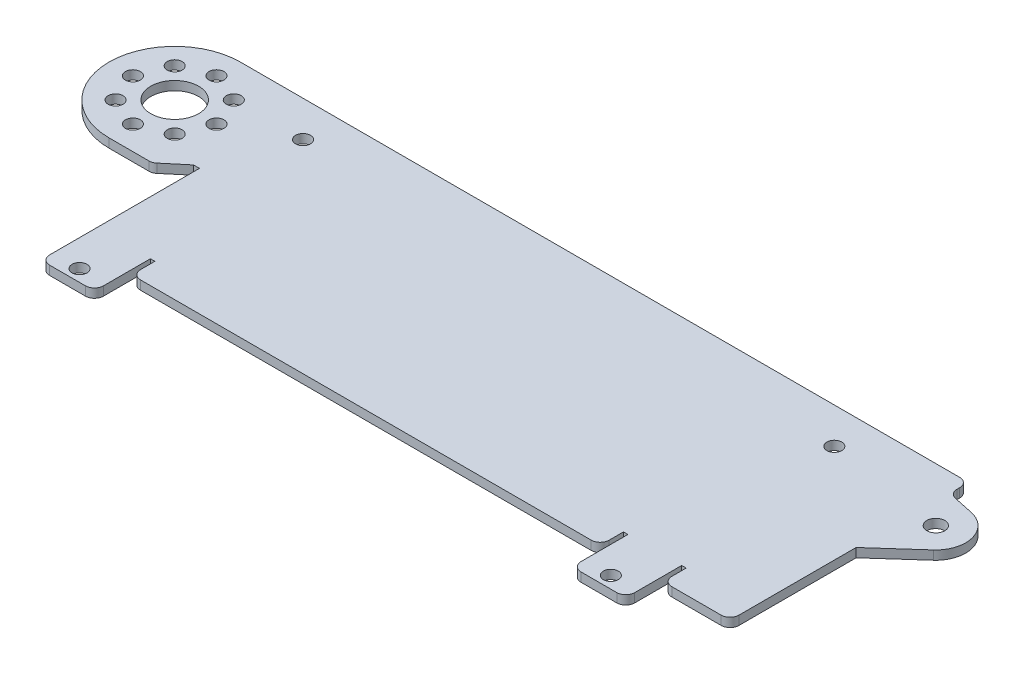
ISO-10303-21;
HEADER;
FILE_DESCRIPTION(('STEP AP214'),'2;1');
FILE_NAME('part.step','',(''),(''),'','','');
FILE_SCHEMA(('AUTOMOTIVE_DESIGN { 1 0 10303 214 1 1 1 1 }'));
ENDSEC;
DATA;
#1=APPLICATION_CONTEXT('core data for automotive mechanical design processes');
#2=APPLICATION_PROTOCOL_DEFINITION('international standard','automotive_design',2000,#1);
#3=PRODUCT_CONTEXT('',#1,'mechanical');
#4=PRODUCT('Part','Part','',(#3));
#5=PRODUCT_RELATED_PRODUCT_CATEGORY('part','',(#4));
#6=PRODUCT_DEFINITION_FORMATION('','',#4);
#7=PRODUCT_DEFINITION_CONTEXT('part definition',#1,'design');
#8=PRODUCT_DEFINITION('design','',#6,#7);
#9=PRODUCT_DEFINITION_SHAPE('','',#8);
#10=(LENGTH_UNIT() NAMED_UNIT(*) SI_UNIT(.MILLI.,.METRE.));
#11=(NAMED_UNIT(*) PLANE_ANGLE_UNIT() SI_UNIT($,.RADIAN.));
#12=(NAMED_UNIT(*) SI_UNIT($,.STERADIAN.) SOLID_ANGLE_UNIT());
#13=UNCERTAINTY_MEASURE_WITH_UNIT(LENGTH_MEASURE(1.E-05),#10,'distance_accuracy_value','');
#14=(GEOMETRIC_REPRESENTATION_CONTEXT(3) GLOBAL_UNCERTAINTY_ASSIGNED_CONTEXT((#13)) GLOBAL_UNIT_ASSIGNED_CONTEXT((#10,
#11,#12)) REPRESENTATION_CONTEXT('',''));
#15=CARTESIAN_POINT('',(0.,0.,0.));
#16=DIRECTION('',(0.,0.,1.));
#17=DIRECTION('',(1.,0.,0.));
#18=AXIS2_PLACEMENT_3D('',#15,#16,#17);
#19=CARTESIAN_POINT('',(0.,0.,0.));
#20=DIRECTION('',(0.,1.,0.));
#21=DIRECTION('',(0.,0.,1.));
#22=AXIS2_PLACEMENT_3D('',#19,#20,#21);
#23=PLANE('',#22);
#24=DIRECTION('',(0.,0.,-1.));
#25=VECTOR('',#24,1.);
#26=CARTESIAN_POINT('',(-45.25,0.,8.46991118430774));
#27=LINE('',#26,#25);
#28=CARTESIAN_POINT('',(-45.25,1.26634813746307E-13,27.4699111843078));
#29=VERTEX_POINT('',#28);
#30=CARTESIAN_POINT('',(-45.25,1.09287578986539E-13,25.0699111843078));
#31=VERTEX_POINT('',#30);
#32=EDGE_CURVE('E655',#29,#31,#27,.T.);
#33=ORIENTED_EDGE('',*,*,#32,.F.);
#34=CARTESIAN_POINT('',(-43.75,1.26634813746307E-13,27.4699111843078));
#35=DIRECTION('',(0.,-1.,0.));
#36=DIRECTION('',(0.,0.,-1.));
#37=AXIS2_PLACEMENT_3D('',#34,#35,#36);
#38=CIRCLE('',#37,1.5);
#39=CARTESIAN_POINT('',(-43.75,1.37043154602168E-13,28.9699111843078));
#40=VERTEX_POINT('',#39);
#41=EDGE_CURVE('E772',#29,#40,#38,.F.);
#42=ORIENTED_EDGE('',*,*,#41,.T.);
#43=DIRECTION('',(1.,0.,0.));
#44=VECTOR('',#43,1.);
#45=CARTESIAN_POINT('',(0.,1.30104260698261E-13,28.9699111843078));
#46=LINE('',#45,#44);
#47=CARTESIAN_POINT('',(31.75,1.2490009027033E-13,28.9699111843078));
#48=VERTEX_POINT('',#47);
#49=EDGE_CURVE('E742',#40,#48,#46,.T.);
#50=ORIENTED_EDGE('',*,*,#49,.T.);
#51=CARTESIAN_POINT('',(31.75,1.14491749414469E-13,27.4699111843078));
#52=DIRECTION('',(0.,-1.,0.));
#53=DIRECTION('',(0.,0.,-1.));
#54=AXIS2_PLACEMENT_3D('',#51,#52,#53);
#55=CIRCLE('',#54,1.5);
#56=CARTESIAN_POINT('',(33.25,1.14491749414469E-13,27.4699111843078));
#57=VERTEX_POINT('',#56);
#58=EDGE_CURVE('E766',#48,#57,#55,.F.);
#59=ORIENTED_EDGE('',*,*,#58,.T.);
#60=DIRECTION('',(0.,0.,1.));
#61=VECTOR('',#60,1.);
#62=CARTESIAN_POINT('',(33.25,0.,8.46991118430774));
#63=LINE('',#62,#61);
#64=CARTESIAN_POINT('',(33.25,0.,25.0699111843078));
#65=VERTEX_POINT('',#64);
#66=EDGE_CURVE('E720',#65,#57,#63,.T.);
#67=ORIENTED_EDGE('',*,*,#66,.F.);
#68=DIRECTION('',(-1.,0.,0.));
#69=VECTOR('',#68,1.);
#70=CARTESIAN_POINT('',(0.,1.02348685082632E-13,25.0699111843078));
#71=LINE('',#70,#69);
#72=CARTESIAN_POINT('',(34.,0.,25.0699111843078));
#73=VERTEX_POINT('',#72);
#74=EDGE_CURVE('E734',#73,#65,#71,.T.);
#75=ORIENTED_EDGE('',*,*,#74,.F.);
#76=DIRECTION('',(0.,0.,-1.));
#77=VECTOR('',#76,1.);
#78=CARTESIAN_POINT('',(34.,0.,8.46991118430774));
#79=LINE('',#78,#77);
#80=CARTESIAN_POINT('',(34.,1.76941794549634E-13,32.9398223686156));
#81=VERTEX_POINT('',#80);
#82=EDGE_CURVE('E730',#81,#73,#79,.T.);
#83=ORIENTED_EDGE('',*,*,#82,.F.);
#84=CARTESIAN_POINT('',(35.5,1.76941794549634E-13,32.9398223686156));
#85=DIRECTION('',(0.,-1.,0.));
#86=DIRECTION('',(0.,0.,-1.));
#87=AXIS2_PLACEMENT_3D('',#84,#85,#86);
#88=CIRCLE('',#87,1.5);
#89=CARTESIAN_POINT('',(35.5,1.99493199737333E-13,34.4398223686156));
#90=VERTEX_POINT('',#89);
#91=EDGE_CURVE('E574',#81,#90,#88,.F.);
#92=ORIENTED_EDGE('',*,*,#91,.T.);
#93=DIRECTION('',(1.,0.,0.));
#94=VECTOR('',#93,1.);
#95=CARTESIAN_POINT('',(0.,1.99493199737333E-13,34.4398223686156));
#96=LINE('',#95,#94);
#97=CARTESIAN_POINT('',(41.5,1.99493199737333E-13,34.4398223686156));
#98=VERTEX_POINT('',#97);
#99=EDGE_CURVE('E570',#90,#98,#96,.T.);
#100=ORIENTED_EDGE('',*,*,#99,.T.);
#101=CARTESIAN_POINT('',(41.5,1.76941794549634E-13,32.9398223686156));
#102=DIRECTION('',(0.,-1.,0.));
#103=DIRECTION('',(0.,0.,-1.));
#104=AXIS2_PLACEMENT_3D('',#101,#102,#103);
#105=CIRCLE('',#104,1.5);
#106=CARTESIAN_POINT('',(43.,1.76941794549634E-13,32.9398223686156));
#107=VERTEX_POINT('',#106);
#108=EDGE_CURVE('E566',#98,#107,#105,.F.);
#109=ORIENTED_EDGE('',*,*,#108,.T.);
#110=DIRECTION('',(0.,0.,1.));
#111=VECTOR('',#110,1.);
#112=CARTESIAN_POINT('',(43.,0.,8.46991118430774));
#113=LINE('',#112,#111);
#114=CARTESIAN_POINT('',(43.,0.,25.0699111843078));
#115=VERTEX_POINT('',#114);
#116=EDGE_CURVE('E727',#115,#107,#113,.T.);
#117=ORIENTED_EDGE('',*,*,#116,.F.);
#118=DIRECTION('',(-1.,0.,0.));
#119=VECTOR('',#118,1.);
#120=CARTESIAN_POINT('',(0.,1.02348685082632E-13,25.0699111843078));
#121=LINE('',#120,#119);
#122=CARTESIAN_POINT('',(43.75,0.,25.0699111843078));
#123=VERTEX_POINT('',#122);
#124=EDGE_CURVE('E723',#123,#115,#121,.T.);
#125=ORIENTED_EDGE('',*,*,#124,.F.);
#126=DIRECTION('',(0.,0.,-1.));
#127=VECTOR('',#126,1.);
#128=CARTESIAN_POINT('',(43.75,0.,8.46991118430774));
#129=LINE('',#128,#127);
#130=CARTESIAN_POINT('',(43.75,1.12757025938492E-13,27.4699111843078));
#131=VERTEX_POINT('',#130);
#132=EDGE_CURVE('E684',#131,#123,#129,.T.);
#133=ORIENTED_EDGE('',*,*,#132,.F.);
#134=CARTESIAN_POINT('',(45.25,1.12757025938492E-13,27.4699111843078));
#135=DIRECTION('',(0.,-1.,0.));
#136=DIRECTION('',(0.,0.,-1.));
#137=AXIS2_PLACEMENT_3D('',#134,#135,#136);
#138=CIRCLE('',#137,1.5);
#139=CARTESIAN_POINT('',(45.25,1.23165366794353E-13,28.9699111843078));
#140=VERTEX_POINT('',#139);
#141=EDGE_CURVE('E769',#131,#140,#138,.F.);
#142=ORIENTED_EDGE('',*,*,#141,.T.);
#143=CARTESIAN_POINT('',(53.5,1.23165366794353E-13,28.9699111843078));
#144=VERTEX_POINT('',#143);
#145=EDGE_CURVE('E743',#140,#144,#46,.T.);
#146=ORIENTED_EDGE('',*,*,#145,.T.);
#147=CARTESIAN_POINT('',(53.5,1.12757025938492E-13,27.4699111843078));
#148=DIRECTION('',(0.,-1.,0.));
#149=DIRECTION('',(0.,0.,-1.));
#150=AXIS2_PLACEMENT_3D('',#147,#148,#149);
#151=CIRCLE('',#150,1.5);
#152=CARTESIAN_POINT('',(55.,1.11022302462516E-13,27.4699111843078));
#153=VERTEX_POINT('',#152);
#154=EDGE_CURVE('E763',#144,#153,#151,.F.);
#155=ORIENTED_EDGE('',*,*,#154,.T.);
#156=DIRECTION('',(0.,0.,-1.));
#157=VECTOR('',#156,1.);
#158=CARTESIAN_POINT('',(55.,0.,8.46991118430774));
#159=LINE('',#158,#157);
#160=CARTESIAN_POINT('',(55.,0.,7.85000000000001));
#161=VERTEX_POINT('',#160);
#162=EDGE_CURVE('E367',#153,#161,#159,.T.);
#163=ORIENTED_EDGE('',*,*,#162,.T.);
#164=DIRECTION('',(0.744743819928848,0.,-0.667350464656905));
#165=VECTOR('',#164,1.);
#166=CARTESIAN_POINT('',(61.8367523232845,0.,1.72371909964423));
#167=LINE('',#166,#165);
#168=CARTESIAN_POINT('',(61.8367523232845,0.,1.72371909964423));
#169=VERTEX_POINT('',#168);
#170=EDGE_CURVE('E344',#161,#169,#167,.T.);
#171=ORIENTED_EDGE('',*,*,#170,.T.);
#172=CARTESIAN_POINT('',(58.5,0.,-2.00000000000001));
#173=DIRECTION('',(0.,1.,0.));
#174=DIRECTION('',(0.,0.,-1.));
#175=AXIS2_PLACEMENT_3D('',#172,#173,#174);
#176=CIRCLE('',#175,5.);
#177=CARTESIAN_POINT('',(59.5337275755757,0.,-6.89197376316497));
#178=VERTEX_POINT('',#177);
#179=EDGE_CURVE('E355',#169,#178,#176,.T.);
#180=ORIENTED_EDGE('',*,*,#179,.T.);
#181=DIRECTION('',(-0.978394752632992,0.,-0.206745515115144));
#182=VECTOR('',#181,1.);
#183=CARTESIAN_POINT('',(55.,0.,-7.85000000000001));
#184=LINE('',#183,#182);
#185=CARTESIAN_POINT('',(56.1898817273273,0.,-7.59856497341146));
#186=VERTEX_POINT('',#185);
#187=EDGE_CURVE('E362',#178,#186,#184,.T.);
#188=ORIENTED_EDGE('',*,*,#187,.T.);
#189=CARTESIAN_POINT('',(56.5,0.,-9.06615710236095));
#190=DIRECTION('',(0.,1.,0.));
#191=DIRECTION('',(0.,0.,1.));
#192=AXIS2_PLACEMENT_3D('',#189,#190,#191);
#193=CIRCLE('',#192,1.5);
#194=CARTESIAN_POINT('',(55.,0.,-9.06615710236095));
#195=VERTEX_POINT('',#194);
#196=EDGE_CURVE('E823',#186,#195,#193,.F.);
#197=ORIENTED_EDGE('',*,*,#196,.T.);
#198=DIRECTION('',(0.,0.,-1.));
#199=VECTOR('',#198,1.);
#200=CARTESIAN_POINT('',(55.,0.,11.));
#201=LINE('',#200,#199);
#202=CARTESIAN_POINT('',(55.,0.,-9.50000000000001));
#203=VERTEX_POINT('',#202);
#204=EDGE_CURVE('E819',#195,#203,#201,.T.);
#205=ORIENTED_EDGE('',*,*,#204,.T.);
#206=CARTESIAN_POINT('',(53.5,0.,-9.50000000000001));
#207=DIRECTION('',(0.,1.,0.));
#208=DIRECTION('',(0.,0.,1.));
#209=AXIS2_PLACEMENT_3D('',#206,#207,#208);
#210=CIRCLE('',#209,1.5);
#211=CARTESIAN_POINT('',(53.5,0.,-11.));
#212=VERTEX_POINT('',#211);
#213=EDGE_CURVE('E816',#203,#212,#210,.T.);
#214=ORIENTED_EDGE('',*,*,#213,.T.);
#215=DIRECTION('',(-1.,0.,0.));
#216=VECTOR('',#215,1.);
#217=CARTESIAN_POINT('',(55.,0.,-11.));
#218=LINE('',#217,#216);
#219=CARTESIAN_POINT('',(-67.,0.,-11.));
#220=VERTEX_POINT('',#219);
#221=EDGE_CURVE('E813',#212,#220,#218,.T.);
#222=ORIENTED_EDGE('',*,*,#221,.T.);
#223=CARTESIAN_POINT('',(-67.,0.,0.));
#224=DIRECTION('',(0.,1.,0.));
#225=DIRECTION('',(0.,0.,1.));
#226=AXIS2_PLACEMENT_3D('',#223,#224,#225);
#227=CIRCLE('',#226,11.);
#228=CARTESIAN_POINT('',(-67.,0.,11.));
#229=VERTEX_POINT('',#228);
#230=EDGE_CURVE('E809',#220,#229,#227,.T.);
#231=ORIENTED_EDGE('',*,*,#230,.T.);
#232=DIRECTION('',(1.,0.,0.));
#233=VECTOR('',#232,1.);
#234=CARTESIAN_POINT('',(-59.7540238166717,0.,11.));
#235=LINE('',#234,#233);
#236=CARTESIAN_POINT('',(-60.299979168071,0.,11.));
#237=VERTEX_POINT('',#236);
#238=EDGE_CURVE('E382',#229,#237,#235,.T.);
#239=ORIENTED_EDGE('',*,*,#238,.T.);
#240=CARTESIAN_POINT('',(-60.299979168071,0.,9.49999999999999));
#241=DIRECTION('',(0.,1.,0.));
#242=DIRECTION('',(0.,0.,1.));
#243=AXIS2_PLACEMENT_3D('',#240,#241,#242);
#244=CIRCLE('',#243,1.5);
#245=CARTESIAN_POINT('',(-59.3357977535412,0.,10.6490666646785));
#246=VERTEX_POINT('',#245);
#247=EDGE_CURVE('E379',#237,#246,#244,.T.);
#248=ORIENTED_EDGE('',*,*,#247,.T.);
#249=DIRECTION('',(0.766044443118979,0.,-0.642787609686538));
#250=VECTOR('',#249,1.);
#251=CARTESIAN_POINT('',(-56.,0.,7.85000000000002));
#252=LINE('',#251,#250);
#253=CARTESIAN_POINT('',(-56.,0.,7.85000000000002));
#254=VERTEX_POINT('',#253);
#255=EDGE_CURVE('E373',#246,#254,#252,.T.);
#256=ORIENTED_EDGE('',*,*,#255,.T.);
#257=DIRECTION('',(1.,0.,0.));
#258=VECTOR('',#257,1.);
#259=CARTESIAN_POINT('',(-55.,0.,7.85000000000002));
#260=LINE('',#259,#258);
#261=CARTESIAN_POINT('',(-55.,0.,7.85000000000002));
#262=VERTEX_POINT('',#261);
#263=EDGE_CURVE('E369',#254,#262,#260,.T.);
#264=ORIENTED_EDGE('',*,*,#263,.T.);
#265=DIRECTION('',(0.,0.,1.));
#266=VECTOR('',#265,1.);
#267=CARTESIAN_POINT('',(-55.,0.,8.46991118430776));
#268=LINE('',#267,#266);
#269=CARTESIAN_POINT('',(-55.,1.90819582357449E-13,32.9398223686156));
#270=VERTEX_POINT('',#269);
#271=EDGE_CURVE('E747',#262,#270,#268,.T.);
#272=ORIENTED_EDGE('',*,*,#271,.T.);
#273=CARTESIAN_POINT('',(-53.5,1.90819582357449E-13,32.9398223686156));
#274=DIRECTION('',(0.,-1.,0.));
#275=DIRECTION('',(0.,0.,-1.));
#276=AXIS2_PLACEMENT_3D('',#273,#274,#275);
#277=CIRCLE('',#276,1.5);
#278=CARTESIAN_POINT('',(-53.5,2.13370987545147E-13,34.4398223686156));
#279=VERTEX_POINT('',#278);
#280=EDGE_CURVE('E619',#270,#279,#277,.F.);
#281=ORIENTED_EDGE('',*,*,#280,.T.);
#282=DIRECTION('',(1.,0.,0.));
#283=VECTOR('',#282,1.);
#284=CARTESIAN_POINT('',(-89.,2.13370987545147E-13,34.4398223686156));
#285=LINE('',#284,#283);
#286=CARTESIAN_POINT('',(-47.5,2.13370987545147E-13,34.4398223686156));
#287=VERTEX_POINT('',#286);
#288=EDGE_CURVE('E615',#279,#287,#285,.T.);
#289=ORIENTED_EDGE('',*,*,#288,.T.);
#290=CARTESIAN_POINT('',(-47.5,1.90819582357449E-13,32.9398223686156));
#291=DIRECTION('',(0.,-1.,0.));
#292=DIRECTION('',(0.,0.,-1.));
#293=AXIS2_PLACEMENT_3D('',#290,#291,#292);
#294=CIRCLE('',#293,1.5);
#295=CARTESIAN_POINT('',(-46.,1.90819582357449E-13,32.9398223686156));
#296=VERTEX_POINT('',#295);
#297=EDGE_CURVE('E611',#287,#296,#294,.F.);
#298=ORIENTED_EDGE('',*,*,#297,.T.);
#299=DIRECTION('',(0.,0.,1.));
#300=VECTOR('',#299,1.);
#301=CARTESIAN_POINT('',(-46.,0.,8.46991118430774));
#302=LINE('',#301,#300);
#303=CARTESIAN_POINT('',(-46.,1.09287578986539E-13,25.0699111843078));
#304=VERTEX_POINT('',#303);
#305=EDGE_CURVE('E677',#304,#296,#302,.T.);
#306=ORIENTED_EDGE('',*,*,#305,.F.);
#307=DIRECTION('',(-1.,0.,0.));
#308=VECTOR('',#307,1.);
#309=CARTESIAN_POINT('',(0.,1.02348685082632E-13,25.0699111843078));
#310=LINE('',#309,#308);
#311=EDGE_CURVE('E673',#31,#304,#310,.T.);
#312=ORIENTED_EDGE('',*,*,#311,.F.);
#313=EDGE_LOOP('',(#33,#42,#50,#59,#67,#75,#83,#92,#100,#109,#117,#125,#133,#142,#146,#155,#163,
#171,#180,#188,#197,#205,#214,#222,#231,#239,#248,#256,#264,#272,#281,#289,#298,#306,#312));
#314=FACE_BOUND('',#313,.T.);
#315=CARTESIAN_POINT('',(-50.5,1.85615411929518E-13,32.4398223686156));
#316=DIRECTION('',(0.,1.,0.));
#317=DIRECTION('',(0.,0.,1.));
#318=AXIS2_PLACEMENT_3D('',#315,#316,#317);
#319=CIRCLE('',#318,1.25);
#320=CARTESIAN_POINT('',(-50.5,2.0301773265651E-13,33.6898223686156));
#321=VERTEX_POINT('',#320);
#322=EDGE_CURVE('E637',#321,#321,#319,.T.);
#323=ORIENTED_EDGE('',*,*,#322,.F.);
#324=EDGE_LOOP('',(#323));
#325=FACE_BOUND('',#324,.T.);
#326=CARTESIAN_POINT('',(38.5,1.71737624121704E-13,32.4398223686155));
#327=DIRECTION('',(0.,1.,0.));
#328=DIRECTION('',(0.,0.,1.));
#329=AXIS2_PLACEMENT_3D('',#326,#327,#328);
#330=CIRCLE('',#329,1.25);
#331=CARTESIAN_POINT('',(38.5,1.89139944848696E-13,33.6898223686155));
#332=VERTEX_POINT('',#331);
#333=EDGE_CURVE('E592',#332,#332,#330,.T.);
#334=ORIENTED_EDGE('',*,*,#333,.F.);
#335=EDGE_LOOP('',(#334));
#336=FACE_BOUND('',#335,.T.);
#337=CARTESIAN_POINT('',(-50.5,0.,-5.00000000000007));
#338=DIRECTION('',(0.,1.,0.));
#339=DIRECTION('',(0.,0.,-1.));
#340=AXIS2_PLACEMENT_3D('',#337,#338,#339);
#341=CIRCLE('',#340,1.25);
#342=CARTESIAN_POINT('',(-50.5,0.,-6.25000000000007));
#343=VERTEX_POINT('',#342);
#344=EDGE_CURVE('E443',#343,#343,#341,.T.);
#345=ORIENTED_EDGE('',*,*,#344,.F.);
#346=EDGE_LOOP('',(#345));
#347=FACE_BOUND('',#346,.T.);
#348=CARTESIAN_POINT('',(38.5,0.,-5.00000000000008));
#349=DIRECTION('',(0.,1.,0.));
#350=DIRECTION('',(0.,0.,-1.));
#351=AXIS2_PLACEMENT_3D('',#348,#349,#350);
#352=CIRCLE('',#351,1.25);
#353=CARTESIAN_POINT('',(38.5,0.,-6.25000000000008));
#354=VERTEX_POINT('',#353);
#355=EDGE_CURVE('E451',#354,#354,#352,.T.);
#356=ORIENTED_EDGE('',*,*,#355,.F.);
#357=EDGE_LOOP('',(#356));
#358=FACE_BOUND('',#357,.T.);
#359=CARTESIAN_POINT('',(-67.,0.,-7.));
#360=DIRECTION('',(0.,1.,0.));
#361=DIRECTION('',(0.,0.,1.));
#362=AXIS2_PLACEMENT_3D('',#359,#360,#361);
#363=CIRCLE('',#362,1.25000000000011);
#364=CARTESIAN_POINT('',(-67.,0.,-5.74999999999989));
#365=VERTEX_POINT('',#364);
#366=EDGE_CURVE('E518',#365,#365,#363,.T.);
#367=ORIENTED_EDGE('',*,*,#366,.F.);
#368=EDGE_LOOP('',(#367));
#369=FACE_BOUND('',#368,.T.);
#370=CARTESIAN_POINT('',(-71.9497474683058,0.,-4.94974746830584));
#371=DIRECTION('',(0.,1.,0.));
#372=DIRECTION('',(0.,0.,1.));
#373=AXIS2_PLACEMENT_3D('',#370,#371,#372);
#374=CIRCLE('',#373,1.25000000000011);
#375=CARTESIAN_POINT('',(-71.9497474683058,0.,-3.69974746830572));
#376=VERTEX_POINT('',#375);
#377=EDGE_CURVE('E522',#376,#376,#374,.T.);
#378=ORIENTED_EDGE('',*,*,#377,.F.);
#379=EDGE_LOOP('',(#378));
#380=FACE_BOUND('',#379,.T.);
#381=CARTESIAN_POINT('',(-74.,0.,0.));
#382=DIRECTION('',(0.,1.,0.));
#383=DIRECTION('',(0.,0.,1.));
#384=AXIS2_PLACEMENT_3D('',#381,#382,#383);
#385=CIRCLE('',#384,1.25000000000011);
#386=CARTESIAN_POINT('',(-74.,0.,1.2500000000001));
#387=VERTEX_POINT('',#386);
#388=EDGE_CURVE('E526',#387,#387,#385,.T.);
#389=ORIENTED_EDGE('',*,*,#388,.F.);
#390=EDGE_LOOP('',(#389));
#391=FACE_BOUND('',#390,.T.);
#392=CARTESIAN_POINT('',(-67.,0.,6.99999999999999));
#393=DIRECTION('',(0.,1.,0.));
#394=DIRECTION('',(0.,0.,1.));
#395=AXIS2_PLACEMENT_3D('',#392,#393,#394);
#396=CIRCLE('',#395,1.24999999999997);
#397=CARTESIAN_POINT('',(-67.,0.,8.24999999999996));
#398=VERTEX_POINT('',#397);
#399=EDGE_CURVE('E530',#398,#398,#396,.T.);
#400=ORIENTED_EDGE('',*,*,#399,.F.);
#401=EDGE_LOOP('',(#400));
#402=FACE_BOUND('',#401,.T.);
#403=CARTESIAN_POINT('',(-62.0502525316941,0.,4.94974746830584));
#404=DIRECTION('',(0.,1.,0.));
#405=DIRECTION('',(0.,0.,1.));
#406=AXIS2_PLACEMENT_3D('',#403,#404,#405);
#407=CIRCLE('',#406,1.25);
#408=CARTESIAN_POINT('',(-62.0502525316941,0.,6.19974746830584));
#409=VERTEX_POINT('',#408);
#410=EDGE_CURVE('E534',#409,#409,#407,.T.);
#411=ORIENTED_EDGE('',*,*,#410,.F.);
#412=EDGE_LOOP('',(#411));
#413=FACE_BOUND('',#412,.T.);
#414=CARTESIAN_POINT('',(-71.9497474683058,0.,4.94974746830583));
#415=DIRECTION('',(0.,1.,0.));
#416=DIRECTION('',(0.,0.,1.));
#417=AXIS2_PLACEMENT_3D('',#414,#415,#416);
#418=CIRCLE('',#417,1.2500000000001);
#419=CARTESIAN_POINT('',(-71.9497474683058,0.,6.19974746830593));
#420=VERTEX_POINT('',#419);
#421=EDGE_CURVE('E538',#420,#420,#418,.T.);
#422=ORIENTED_EDGE('',*,*,#421,.F.);
#423=EDGE_LOOP('',(#422));
#424=FACE_BOUND('',#423,.T.);
#425=CARTESIAN_POINT('',(-60.,0.,0.));
#426=DIRECTION('',(0.,1.,0.));
#427=DIRECTION('',(0.,0.,1.));
#428=AXIS2_PLACEMENT_3D('',#425,#426,#427);
#429=CIRCLE('',#428,1.25);
#430=CARTESIAN_POINT('',(-60.,0.,1.25));
#431=VERTEX_POINT('',#430);
#432=EDGE_CURVE('E542',#431,#431,#429,.T.);
#433=ORIENTED_EDGE('',*,*,#432,.F.);
#434=EDGE_LOOP('',(#433));
#435=FACE_BOUND('',#434,.T.);
#436=CARTESIAN_POINT('',(-62.0502525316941,0.,-4.94974746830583));
#437=DIRECTION('',(0.,1.,0.));
#438=DIRECTION('',(0.,0.,1.));
#439=AXIS2_PLACEMENT_3D('',#436,#437,#438);
#440=CIRCLE('',#439,1.25000000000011);
#441=CARTESIAN_POINT('',(-62.0502525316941,0.,-3.69974746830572));
#442=VERTEX_POINT('',#441);
#443=EDGE_CURVE('E546',#442,#442,#440,.T.);
#444=ORIENTED_EDGE('',*,*,#443,.F.);
#445=EDGE_LOOP('',(#444));
#446=FACE_BOUND('',#445,.T.);
#447=CARTESIAN_POINT('',(-67.,0.,0.));
#448=DIRECTION('',(0.,1.,0.));
#449=DIRECTION('',(0.,0.,1.));
#450=AXIS2_PLACEMENT_3D('',#447,#448,#449);
#451=CIRCLE('',#450,4.00000000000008);
#452=CARTESIAN_POINT('',(-67.,0.,4.00000000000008));
#453=VERTEX_POINT('',#452);
#454=EDGE_CURVE('E550',#453,#453,#451,.T.);
#455=ORIENTED_EDGE('',*,*,#454,.F.);
#456=EDGE_LOOP('',(#455));
#457=FACE_BOUND('',#456,.T.);
#458=CARTESIAN_POINT('',(58.5,0.,-2.00000000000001));
#459=DIRECTION('',(0.,1.,0.));
#460=DIRECTION('',(0.,0.,1.));
#461=AXIS2_PLACEMENT_3D('',#458,#459,#460);
#462=CIRCLE('',#461,1.5);
#463=CARTESIAN_POINT('',(58.5,0.,-0.500000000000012));
#464=VERTEX_POINT('',#463);
#465=EDGE_CURVE('E554',#464,#464,#462,.T.);
#466=ORIENTED_EDGE('',*,*,#465,.F.);
#467=EDGE_LOOP('',(#466));
#468=FACE_BOUND('',#467,.T.);
#469=ADVANCED_FACE('F111',(#314,#325,#336,#347,#358,#369,#380,#391,#402,#413,#424,#435,#446,
#457,#468),#23,.T.);
#470=CARTESIAN_POINT('',(0.,-1.50000000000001,8.46991118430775));
#471=DIRECTION('',(0.,-1.,0.));
#472=DIRECTION('',(0.,0.,-1.));
#473=AXIS2_PLACEMENT_3D('',#470,#471,#472);
#474=PLANE('',#473);
#475=DIRECTION('',(-1.,0.,0.));
#476=VECTOR('',#475,1.);
#477=CARTESIAN_POINT('',(55.,-1.49999999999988,28.9699111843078));
#478=LINE('',#477,#476);
#479=CARTESIAN_POINT('',(-43.75,-1.49999999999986,28.9699111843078));
#480=VERTEX_POINT('',#479);
#481=CARTESIAN_POINT('',(31.75,-1.49999999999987,28.9699111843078));
#482=VERTEX_POINT('',#481);
#483=EDGE_CURVE('E753',#480,#482,#478,.F.);
#484=ORIENTED_EDGE('',*,*,#483,.F.);
#485=CARTESIAN_POINT('',(-43.75,-1.49999999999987,27.4699111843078));
#486=DIRECTION('',(0.,-1.,0.));
#487=DIRECTION('',(0.,0.,-1.));
#488=AXIS2_PLACEMENT_3D('',#485,#486,#487);
#489=CIRCLE('',#488,1.5);
#490=CARTESIAN_POINT('',(-45.25,-1.49999999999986,27.4699111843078));
#491=VERTEX_POINT('',#490);
#492=EDGE_CURVE('E790',#480,#491,#489,.T.);
#493=ORIENTED_EDGE('',*,*,#492,.T.);
#494=DIRECTION('',(0.,0.,1.));
#495=VECTOR('',#494,1.);
#496=CARTESIAN_POINT('',(-45.25,-1.49999999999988,25.0699111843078));
#497=LINE('',#496,#495);
#498=CARTESIAN_POINT('',(-45.25,-1.49999999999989,25.0699111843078));
#499=VERTEX_POINT('',#498);
#500=EDGE_CURVE('E661',#499,#491,#497,.T.);
#501=ORIENTED_EDGE('',*,*,#500,.F.);
#502=DIRECTION('',(1.,0.,0.));
#503=VECTOR('',#502,1.);
#504=CARTESIAN_POINT('',(-46.,-1.49999999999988,25.0699111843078));
#505=LINE('',#504,#503);
#506=CARTESIAN_POINT('',(-46.,-1.49999999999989,25.0699111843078));
#507=VERTEX_POINT('',#506);
#508=EDGE_CURVE('E656',#507,#499,#505,.T.);
#509=ORIENTED_EDGE('',*,*,#508,.F.);
#510=DIRECTION('',(0.,0.,-1.));
#511=VECTOR('',#510,1.);
#512=CARTESIAN_POINT('',(-46.,-1.49999999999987,25.8199111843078));
#513=LINE('',#512,#511);
#514=CARTESIAN_POINT('',(-46.,-1.49999999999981,32.9398223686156));
#515=VERTEX_POINT('',#514);
#516=EDGE_CURVE('E651',#515,#507,#513,.T.);
#517=ORIENTED_EDGE('',*,*,#516,.F.);
#518=CARTESIAN_POINT('',(-47.5,-1.49999999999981,32.9398223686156));
#519=DIRECTION('',(0.,-1.,0.));
#520=DIRECTION('',(0.,0.,-1.));
#521=AXIS2_PLACEMENT_3D('',#518,#519,#520);
#522=CIRCLE('',#521,1.5);
#523=CARTESIAN_POINT('',(-47.5,-1.49999999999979,34.4398223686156));
#524=VERTEX_POINT('',#523);
#525=EDGE_CURVE('E626',#515,#524,#522,.T.);
#526=ORIENTED_EDGE('',*,*,#525,.T.);
#527=DIRECTION('',(-1.,0.,0.));
#528=VECTOR('',#527,1.);
#529=CARTESIAN_POINT('',(-46.,-1.49999999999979,34.4398223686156));
#530=LINE('',#529,#528);
#531=CARTESIAN_POINT('',(-53.5,-1.49999999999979,34.4398223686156));
#532=VERTEX_POINT('',#531);
#533=EDGE_CURVE('E644',#532,#524,#530,.F.);
#534=ORIENTED_EDGE('',*,*,#533,.F.);
#535=CARTESIAN_POINT('',(-53.5,-1.49999999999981,32.9398223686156));
#536=DIRECTION('',(0.,-1.,0.));
#537=DIRECTION('',(0.,0.,-1.));
#538=AXIS2_PLACEMENT_3D('',#535,#536,#537);
#539=CIRCLE('',#538,1.5);
#540=CARTESIAN_POINT('',(-55.,-1.49999999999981,32.9398223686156));
#541=VERTEX_POINT('',#540);
#542=EDGE_CURVE('E629',#532,#541,#539,.T.);
#543=ORIENTED_EDGE('',*,*,#542,.T.);
#544=DIRECTION('',(0.,0.,-1.));
#545=VECTOR('',#544,1.);
#546=CARTESIAN_POINT('',(-55.,-1.49999999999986,28.9699111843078));
#547=LINE('',#546,#545);
#548=CARTESIAN_POINT('',(-55.,-1.5,7.85000000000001));
#549=VERTEX_POINT('',#548);
#550=EDGE_CURVE('E738',#549,#541,#547,.F.);
#551=ORIENTED_EDGE('',*,*,#550,.F.);
#552=DIRECTION('',(1.,0.,0.));
#553=VECTOR('',#552,1.);
#554=CARTESIAN_POINT('',(-55.,-1.5,7.85000000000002));
#555=LINE('',#554,#553);
#556=CARTESIAN_POINT('',(-56.,-1.5,7.85000000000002));
#557=VERTEX_POINT('',#556);
#558=EDGE_CURVE('E390',#557,#549,#555,.T.);
#559=ORIENTED_EDGE('',*,*,#558,.F.);
#560=DIRECTION('',(0.766044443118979,0.,-0.642787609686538));
#561=VECTOR('',#560,1.);
#562=CARTESIAN_POINT('',(-56.,-1.5,7.85000000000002));
#563=LINE('',#562,#561);
#564=CARTESIAN_POINT('',(-59.3357977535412,-1.5,10.6490666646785));
#565=VERTEX_POINT('',#564);
#566=EDGE_CURVE('E463',#565,#557,#563,.T.);
#567=ORIENTED_EDGE('',*,*,#566,.F.);
#568=CARTESIAN_POINT('',(-60.299979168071,-1.5,9.49999999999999));
#569=DIRECTION('',(0.,1.,0.));
#570=DIRECTION('',(0.,0.,1.));
#571=AXIS2_PLACEMENT_3D('',#568,#569,#570);
#572=CIRCLE('',#571,1.5);
#573=CARTESIAN_POINT('',(-60.299979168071,-1.5,11.));
#574=VERTEX_POINT('',#573);
#575=EDGE_CURVE('E440',#565,#574,#572,.F.);
#576=ORIENTED_EDGE('',*,*,#575,.T.);
#577=DIRECTION('',(1.,0.,0.));
#578=VECTOR('',#577,1.);
#579=CARTESIAN_POINT('',(-59.7540238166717,-1.5,11.));
#580=LINE('',#579,#578);
#581=CARTESIAN_POINT('',(-67.,-1.5,11.));
#582=VERTEX_POINT('',#581);
#583=EDGE_CURVE('E473',#582,#574,#580,.T.);
#584=ORIENTED_EDGE('',*,*,#583,.F.);
#585=CARTESIAN_POINT('',(-67.,-1.5,0.));
#586=DIRECTION('',(0.,1.,0.));
#587=DIRECTION('',(0.,0.,1.));
#588=AXIS2_PLACEMENT_3D('',#585,#586,#587);
#589=CIRCLE('',#588,11.);
#590=CARTESIAN_POINT('',(-67.,-1.5,-11.));
#591=VERTEX_POINT('',#590);
#592=EDGE_CURVE('E480',#591,#582,#589,.T.);
#593=ORIENTED_EDGE('',*,*,#592,.F.);
#594=DIRECTION('',(-1.,0.,0.));
#595=VECTOR('',#594,1.);
#596=CARTESIAN_POINT('',(55.,-1.5,-11.));
#597=LINE('',#596,#595);
#598=CARTESIAN_POINT('',(53.5,-1.5,-11.));
#599=VERTEX_POINT('',#598);
#600=EDGE_CURVE('E488',#599,#591,#597,.T.);
#601=ORIENTED_EDGE('',*,*,#600,.F.);
#602=CARTESIAN_POINT('',(53.5,-1.5,-9.50000000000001));
#603=DIRECTION('',(0.,1.,0.));
#604=DIRECTION('',(0.,0.,1.));
#605=AXIS2_PLACEMENT_3D('',#602,#603,#604);
#606=CIRCLE('',#605,1.5);
#607=CARTESIAN_POINT('',(55.,-1.5,-9.50000000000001));
#608=VERTEX_POINT('',#607);
#609=EDGE_CURVE('E437',#599,#608,#606,.F.);
#610=ORIENTED_EDGE('',*,*,#609,.T.);
#611=DIRECTION('',(0.,0.,-1.));
#612=VECTOR('',#611,1.);
#613=CARTESIAN_POINT('',(55.,-1.5,11.));
#614=LINE('',#613,#612);
#615=CARTESIAN_POINT('',(55.,-1.5,-9.06615710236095));
#616=VERTEX_POINT('',#615);
#617=EDGE_CURVE('E498',#616,#608,#614,.T.);
#618=ORIENTED_EDGE('',*,*,#617,.F.);
#619=CARTESIAN_POINT('',(56.5,-1.5,-9.06615710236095));
#620=DIRECTION('',(0.,1.,0.));
#621=DIRECTION('',(0.,0.,1.));
#622=AXIS2_PLACEMENT_3D('',#619,#620,#621);
#623=CIRCLE('',#622,1.5);
#624=CARTESIAN_POINT('',(56.1898817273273,-1.5,-7.59856497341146));
#625=VERTEX_POINT('',#624);
#626=EDGE_CURVE('E434',#616,#625,#623,.T.);
#627=ORIENTED_EDGE('',*,*,#626,.T.);
#628=DIRECTION('',(-0.978394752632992,0.,-0.206745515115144));
#629=VECTOR('',#628,1.);
#630=CARTESIAN_POINT('',(55.,-1.5,-7.85000000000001));
#631=LINE('',#630,#629);
#632=CARTESIAN_POINT('',(59.5337275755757,-1.5,-6.89197376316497));
#633=VERTEX_POINT('',#632);
#634=EDGE_CURVE('E509',#633,#625,#631,.T.);
#635=ORIENTED_EDGE('',*,*,#634,.F.);
#636=CARTESIAN_POINT('',(58.5,-1.5,-2.00000000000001));
#637=DIRECTION('',(0.,1.,0.));
#638=DIRECTION('',(0.,0.,-1.));
#639=AXIS2_PLACEMENT_3D('',#636,#637,#638);
#640=CIRCLE('',#639,5.);
#641=CARTESIAN_POINT('',(61.8367523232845,-1.5,1.72371909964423));
#642=VERTEX_POINT('',#641);
#643=EDGE_CURVE('E515',#642,#633,#640,.T.);
#644=ORIENTED_EDGE('',*,*,#643,.F.);
#645=DIRECTION('',(0.744743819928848,0.,-0.667350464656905));
#646=VECTOR('',#645,1.);
#647=CARTESIAN_POINT('',(61.8367523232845,-1.5,1.72371909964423));
#648=LINE('',#647,#646);
#649=CARTESIAN_POINT('',(55.,-1.5,7.85000000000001));
#650=VERTEX_POINT('',#649);
#651=EDGE_CURVE('E347',#650,#642,#648,.T.);
#652=ORIENTED_EDGE('',*,*,#651,.F.);
#653=DIRECTION('',(0.,0.,1.));
#654=VECTOR('',#653,1.);
#655=CARTESIAN_POINT('',(55.,-1.50000000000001,9.96991118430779));
#656=LINE('',#655,#654);
#657=CARTESIAN_POINT('',(55.,-1.49999999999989,27.4699111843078));
#658=VERTEX_POINT('',#657);
#659=EDGE_CURVE('E750',#658,#650,#656,.F.);
#660=ORIENTED_EDGE('',*,*,#659,.F.);
#661=CARTESIAN_POINT('',(53.5,-1.49999999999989,27.4699111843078));
#662=DIRECTION('',(0.,-1.,0.));
#663=DIRECTION('',(0.,0.,-1.));
#664=AXIS2_PLACEMENT_3D('',#661,#662,#663);
#665=CIRCLE('',#664,1.5);
#666=CARTESIAN_POINT('',(53.5,-1.49999999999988,28.9699111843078));
#667=VERTEX_POINT('',#666);
#668=EDGE_CURVE('E782',#658,#667,#665,.T.);
#669=ORIENTED_EDGE('',*,*,#668,.T.);
#670=CARTESIAN_POINT('',(45.25,-1.49999999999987,28.9699111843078));
#671=VERTEX_POINT('',#670);
#672=EDGE_CURVE('E754',#671,#667,#478,.F.);
#673=ORIENTED_EDGE('',*,*,#672,.F.);
#674=CARTESIAN_POINT('',(45.25,-1.49999999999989,27.4699111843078));
#675=DIRECTION('',(0.,-1.,0.));
#676=DIRECTION('',(0.,0.,-1.));
#677=AXIS2_PLACEMENT_3D('',#674,#675,#676);
#678=CIRCLE('',#677,1.5);
#679=CARTESIAN_POINT('',(43.75,-1.49999999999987,27.4699111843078));
#680=VERTEX_POINT('',#679);
#681=EDGE_CURVE('E133',#671,#680,#678,.T.);
#682=ORIENTED_EDGE('',*,*,#681,.T.);
#683=DIRECTION('',(0.,0.,1.));
#684=VECTOR('',#683,1.);
#685=CARTESIAN_POINT('',(43.75,-1.49999999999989,25.0699111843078));
#686=LINE('',#685,#684);
#687=CARTESIAN_POINT('',(43.75,-1.4999999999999,25.0699111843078));
#688=VERTEX_POINT('',#687);
#689=EDGE_CURVE('E703',#688,#680,#686,.T.);
#690=ORIENTED_EDGE('',*,*,#689,.F.);
#691=DIRECTION('',(1.,0.,0.));
#692=VECTOR('',#691,1.);
#693=CARTESIAN_POINT('',(43.,-1.49999999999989,25.0699111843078));
#694=LINE('',#693,#692);
#695=CARTESIAN_POINT('',(43.,-1.4999999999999,25.0699111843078));
#696=VERTEX_POINT('',#695);
#697=EDGE_CURVE('E698',#696,#688,#694,.T.);
#698=ORIENTED_EDGE('',*,*,#697,.F.);
#699=DIRECTION('',(0.,0.,-1.));
#700=VECTOR('',#699,1.);
#701=CARTESIAN_POINT('',(43.,-1.49999999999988,25.8199111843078));
#702=LINE('',#701,#700);
#703=CARTESIAN_POINT('',(43.,-1.49999999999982,32.9398223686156));
#704=VERTEX_POINT('',#703);
#705=EDGE_CURVE('E694',#704,#696,#702,.T.);
#706=ORIENTED_EDGE('',*,*,#705,.F.);
#707=CARTESIAN_POINT('',(41.5,-1.49999999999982,32.9398223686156));
#708=DIRECTION('',(0.,-1.,0.));
#709=DIRECTION('',(0.,0.,-1.));
#710=AXIS2_PLACEMENT_3D('',#707,#708,#709);
#711=CIRCLE('',#710,1.5);
#712=CARTESIAN_POINT('',(41.5,-1.4999999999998,34.4398223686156));
#713=VERTEX_POINT('',#712);
#714=EDGE_CURVE('E581',#704,#713,#711,.T.);
#715=ORIENTED_EDGE('',*,*,#714,.T.);
#716=DIRECTION('',(-1.,0.,0.));
#717=VECTOR('',#716,1.);
#718=CARTESIAN_POINT('',(43.,-1.4999999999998,34.4398223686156));
#719=LINE('',#718,#717);
#720=CARTESIAN_POINT('',(35.5,-1.4999999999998,34.4398223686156));
#721=VERTEX_POINT('',#720);
#722=EDGE_CURVE('E599',#721,#713,#719,.F.);
#723=ORIENTED_EDGE('',*,*,#722,.F.);
#724=CARTESIAN_POINT('',(35.5,-1.49999999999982,32.9398223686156));
#725=DIRECTION('',(0.,-1.,0.));
#726=DIRECTION('',(0.,0.,-1.));
#727=AXIS2_PLACEMENT_3D('',#724,#725,#726);
#728=CIRCLE('',#727,1.5);
#729=CARTESIAN_POINT('',(34.,-1.49999999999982,32.9398223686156));
#730=VERTEX_POINT('',#729);
#731=EDGE_CURVE('E584',#721,#730,#728,.T.);
#732=ORIENTED_EDGE('',*,*,#731,.T.);
#733=DIRECTION('',(0.,0.,1.));
#734=VECTOR('',#733,1.);
#735=CARTESIAN_POINT('',(34.,-1.49999999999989,25.0699111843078));
#736=LINE('',#735,#734);
#737=CARTESIAN_POINT('',(34.,-1.4999999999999,25.0699111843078));
#738=VERTEX_POINT('',#737);
#739=EDGE_CURVE('E690',#738,#730,#736,.T.);
#740=ORIENTED_EDGE('',*,*,#739,.F.);
#741=DIRECTION('',(1.,0.,0.));
#742=VECTOR('',#741,1.);
#743=CARTESIAN_POINT('',(33.25,-1.49999999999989,25.0699111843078));
#744=LINE('',#743,#742);
#745=CARTESIAN_POINT('',(33.25,-1.4999999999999,25.0699111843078));
#746=VERTEX_POINT('',#745);
#747=EDGE_CURVE('E685',#746,#738,#744,.T.);
#748=ORIENTED_EDGE('',*,*,#747,.F.);
#749=DIRECTION('',(0.,0.,-1.));
#750=VECTOR('',#749,1.);
#751=CARTESIAN_POINT('',(33.25,-1.49999999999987,28.9699111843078));
#752=LINE('',#751,#750);
#753=CARTESIAN_POINT('',(33.25,-1.49999999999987,27.4699111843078));
#754=VERTEX_POINT('',#753);
#755=EDGE_CURVE('E681',#754,#746,#752,.T.);
#756=ORIENTED_EDGE('',*,*,#755,.F.);
#757=CARTESIAN_POINT('',(31.75,-1.49999999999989,27.4699111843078));
#758=DIRECTION('',(0.,-1.,0.));
#759=DIRECTION('',(0.,0.,-1.));
#760=AXIS2_PLACEMENT_3D('',#757,#758,#759);
#761=CIRCLE('',#760,1.5);
#762=EDGE_CURVE('E785',#754,#482,#761,.T.);
#763=ORIENTED_EDGE('',*,*,#762,.T.);
#764=EDGE_LOOP('',(#484,#493,#501,#509,#517,#526,#534,#543,#551,#559,#567,#576,#584,#593,#601,
#610,#618,#627,#635,#644,#652,#660,#669,#673,#682,#690,#698,#706,#715,#723,#732,#740,#748,#756,#763));
#765=FACE_BOUND('',#764,.T.);
#766=CARTESIAN_POINT('',(-50.5,-1.49999999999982,32.4398223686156));
#767=DIRECTION('',(0.,-1.,0.));
#768=DIRECTION('',(0.,0.,-1.));
#769=AXIS2_PLACEMENT_3D('',#766,#767,#768);
#770=CIRCLE('',#769,1.25);
#771=CARTESIAN_POINT('',(-50.5,-1.49999999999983,31.1898223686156));
#772=VERTEX_POINT('',#771);
#773=EDGE_CURVE('E633',#772,#772,#770,.F.);
#774=ORIENTED_EDGE('',*,*,#773,.T.);
#775=EDGE_LOOP('',(#774));
#776=FACE_BOUND('',#775,.T.);
#777=CARTESIAN_POINT('',(38.5,-1.49999999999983,32.4398223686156));
#778=DIRECTION('',(0.,-1.,0.));
#779=DIRECTION('',(0.,0.,-1.));
#780=AXIS2_PLACEMENT_3D('',#777,#778,#779);
#781=CIRCLE('',#780,1.25);
#782=CARTESIAN_POINT('',(38.5,-1.49999999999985,31.1898223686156));
#783=VERTEX_POINT('',#782);
#784=EDGE_CURVE('E588',#783,#783,#781,.F.);
#785=ORIENTED_EDGE('',*,*,#784,.T.);
#786=EDGE_LOOP('',(#785));
#787=FACE_BOUND('',#786,.T.);
#788=CARTESIAN_POINT('',(-50.5,-1.5,-5.00000000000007));
#789=DIRECTION('',(0.,1.,0.));
#790=DIRECTION('',(0.,0.,1.));
#791=AXIS2_PLACEMENT_3D('',#788,#789,#790);
#792=CIRCLE('',#791,1.25);
#793=CARTESIAN_POINT('',(-50.5,-1.5,-3.75000000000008));
#794=VERTEX_POINT('',#793);
#795=EDGE_CURVE('E447',#794,#794,#792,.F.);
#796=ORIENTED_EDGE('',*,*,#795,.F.);
#797=EDGE_LOOP('',(#796));
#798=FACE_BOUND('',#797,.T.);
#799=CARTESIAN_POINT('',(38.5,-1.5,-5.00000000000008));
#800=DIRECTION('',(0.,1.,0.));
#801=DIRECTION('',(0.,0.,1.));
#802=AXIS2_PLACEMENT_3D('',#799,#800,#801);
#803=CIRCLE('',#802,1.25);
#804=CARTESIAN_POINT('',(38.5,-1.5,-3.75000000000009));
#805=VERTEX_POINT('',#804);
#806=EDGE_CURVE('E455',#805,#805,#803,.F.);
#807=ORIENTED_EDGE('',*,*,#806,.F.);
#808=EDGE_LOOP('',(#807));
#809=FACE_BOUND('',#808,.T.);
#810=CARTESIAN_POINT('',(-67.,-1.5,-7.));
#811=DIRECTION('',(0.,1.,0.));
#812=DIRECTION('',(0.,0.,1.));
#813=AXIS2_PLACEMENT_3D('',#810,#811,#812);
#814=CIRCLE('',#813,1.25000000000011);
#815=CARTESIAN_POINT('',(-67.,-1.5,-5.74999999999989));
#816=VERTEX_POINT('',#815);
#817=EDGE_CURVE('E430',#816,#816,#814,.T.);
#818=ORIENTED_EDGE('',*,*,#817,.T.);
#819=EDGE_LOOP('',(#818));
#820=FACE_BOUND('',#819,.T.);
#821=CARTESIAN_POINT('',(-71.9497474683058,-1.5,-4.94974746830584));
#822=DIRECTION('',(0.,1.,0.));
#823=DIRECTION('',(0.,0.,1.));
#824=AXIS2_PLACEMENT_3D('',#821,#822,#823);
#825=CIRCLE('',#824,1.25000000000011);
#826=CARTESIAN_POINT('',(-71.9497474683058,-1.5,-3.69974746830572));
#827=VERTEX_POINT('',#826);
#828=EDGE_CURVE('E426',#827,#827,#825,.T.);
#829=ORIENTED_EDGE('',*,*,#828,.T.);
#830=EDGE_LOOP('',(#829));
#831=FACE_BOUND('',#830,.T.);
#832=CARTESIAN_POINT('',(-74.,-1.5,0.));
#833=DIRECTION('',(0.,1.,0.));
#834=DIRECTION('',(0.,0.,1.));
#835=AXIS2_PLACEMENT_3D('',#832,#833,#834);
#836=CIRCLE('',#835,1.25000000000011);
#837=CARTESIAN_POINT('',(-74.,-1.5,1.2500000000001));
#838=VERTEX_POINT('',#837);
#839=EDGE_CURVE('E422',#838,#838,#836,.T.);
#840=ORIENTED_EDGE('',*,*,#839,.T.);
#841=EDGE_LOOP('',(#840));
#842=FACE_BOUND('',#841,.T.);
#843=CARTESIAN_POINT('',(-67.,-1.5,6.99999999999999));
#844=DIRECTION('',(0.,1.,0.));
#845=DIRECTION('',(0.,0.,1.));
#846=AXIS2_PLACEMENT_3D('',#843,#844,#845);
#847=CIRCLE('',#846,1.24999999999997);
#848=CARTESIAN_POINT('',(-67.,-1.5,8.24999999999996));
#849=VERTEX_POINT('',#848);
#850=EDGE_CURVE('E418',#849,#849,#847,.T.);
#851=ORIENTED_EDGE('',*,*,#850,.T.);
#852=EDGE_LOOP('',(#851));
#853=FACE_BOUND('',#852,.T.);
#854=CARTESIAN_POINT('',(-62.0502525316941,-1.5,4.94974746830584));
#855=DIRECTION('',(0.,1.,0.));
#856=DIRECTION('',(0.,0.,1.));
#857=AXIS2_PLACEMENT_3D('',#854,#855,#856);
#858=CIRCLE('',#857,1.25);
#859=CARTESIAN_POINT('',(-62.0502525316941,-1.5,6.19974746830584));
#860=VERTEX_POINT('',#859);
#861=EDGE_CURVE('E414',#860,#860,#858,.T.);
#862=ORIENTED_EDGE('',*,*,#861,.T.);
#863=EDGE_LOOP('',(#862));
#864=FACE_BOUND('',#863,.T.);
#865=CARTESIAN_POINT('',(-71.9497474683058,-1.5,4.94974746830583));
#866=DIRECTION('',(0.,1.,0.));
#867=DIRECTION('',(0.,0.,1.));
#868=AXIS2_PLACEMENT_3D('',#865,#866,#867);
#869=CIRCLE('',#868,1.2500000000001);
#870=CARTESIAN_POINT('',(-71.9497474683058,-1.5,6.19974746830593));
#871=VERTEX_POINT('',#870);
#872=EDGE_CURVE('E410',#871,#871,#869,.T.);
#873=ORIENTED_EDGE('',*,*,#872,.T.);
#874=EDGE_LOOP('',(#873));
#875=FACE_BOUND('',#874,.T.);
#876=CARTESIAN_POINT('',(-60.,-1.5,0.));
#877=DIRECTION('',(0.,1.,0.));
#878=DIRECTION('',(0.,0.,1.));
#879=AXIS2_PLACEMENT_3D('',#876,#877,#878);
#880=CIRCLE('',#879,1.25);
#881=CARTESIAN_POINT('',(-60.,-1.5,1.25));
#882=VERTEX_POINT('',#881);
#883=EDGE_CURVE('E406',#882,#882,#880,.T.);
#884=ORIENTED_EDGE('',*,*,#883,.T.);
#885=EDGE_LOOP('',(#884));
#886=FACE_BOUND('',#885,.T.);
#887=CARTESIAN_POINT('',(-62.0502525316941,-1.5,-4.94974746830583));
#888=DIRECTION('',(0.,1.,0.));
#889=DIRECTION('',(0.,0.,1.));
#890=AXIS2_PLACEMENT_3D('',#887,#888,#889);
#891=CIRCLE('',#890,1.25000000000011);
#892=CARTESIAN_POINT('',(-62.0502525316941,-1.5,-3.69974746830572));
#893=VERTEX_POINT('',#892);
#894=EDGE_CURVE('E402',#893,#893,#891,.T.);
#895=ORIENTED_EDGE('',*,*,#894,.T.);
#896=EDGE_LOOP('',(#895));
#897=FACE_BOUND('',#896,.T.);
#898=CARTESIAN_POINT('',(-67.,-1.5,0.));
#899=DIRECTION('',(0.,1.,0.));
#900=DIRECTION('',(0.,0.,1.));
#901=AXIS2_PLACEMENT_3D('',#898,#899,#900);
#902=CIRCLE('',#901,4.00000000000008);
#903=CARTESIAN_POINT('',(-67.,-1.5,4.00000000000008));
#904=VERTEX_POINT('',#903);
#905=EDGE_CURVE('E398',#904,#904,#902,.T.);
#906=ORIENTED_EDGE('',*,*,#905,.T.);
#907=EDGE_LOOP('',(#906));
#908=FACE_BOUND('',#907,.T.);
#909=CARTESIAN_POINT('',(58.5,-1.5,-2.00000000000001));
#910=DIRECTION('',(0.,1.,0.));
#911=DIRECTION('',(0.,0.,1.));
#912=AXIS2_PLACEMENT_3D('',#909,#910,#911);
#913=CIRCLE('',#912,1.5);
#914=CARTESIAN_POINT('',(58.5,-1.5,-0.500000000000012));
#915=VERTEX_POINT('',#914);
#916=EDGE_CURVE('E394',#915,#915,#913,.T.);
#917=ORIENTED_EDGE('',*,*,#916,.T.);
#918=EDGE_LOOP('',(#917));
#919=FACE_BOUND('',#918,.T.);
#920=ADVANCED_FACE('F841',(#765,#776,#787,#798,#809,#820,#831,#842,#853,#864,#875,#886,#897,
#908,#919),#474,.T.);
#921=CARTESIAN_POINT('',(55.,1.23165366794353E-13,28.9699111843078));
#922=DIRECTION('',(0.,0.,-1.));
#923=DIRECTION('',(0.,1.,0.));
#924=AXIS2_PLACEMENT_3D('',#921,#922,#923);
#925=PLANE('',#924);
#926=ORIENTED_EDGE('',*,*,#49,.F.);
#927=DIRECTION('',(0.,1.,0.));
#928=VECTOR('',#927,1.);
#929=CARTESIAN_POINT('',(-43.75,-1.49999999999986,28.9699111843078));
#930=LINE('',#929,#928);
#931=EDGE_CURVE('E779',#40,#480,#930,.F.);
#932=ORIENTED_EDGE('',*,*,#931,.T.);
#933=ORIENTED_EDGE('',*,*,#483,.T.);
#934=DIRECTION('',(0.,1.,0.));
#935=VECTOR('',#934,1.);
#936=CARTESIAN_POINT('',(31.75,1.2490009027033E-13,28.9699111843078));
#937=LINE('',#936,#935);
#938=EDGE_CURVE('E775',#482,#48,#937,.T.);
#939=ORIENTED_EDGE('',*,*,#938,.T.);
#940=EDGE_LOOP('',(#926,#932,#933,#939));
#941=FACE_BOUND('',#940,.T.);
#942=ADVANCED_FACE('F907',(#941),#925,.F.);
#943=CARTESIAN_POINT('',(-55.,1.38777878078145E-13,28.9699111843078));
#944=DIRECTION('',(1.,0.,0.));
#945=DIRECTION('',(0.,0.,-1.));
#946=AXIS2_PLACEMENT_3D('',#943,#944,#945);
#947=PLANE('',#946);
#948=ORIENTED_EDGE('',*,*,#550,.T.);
#949=DIRECTION('',(0.,-1.,0.));
#950=VECTOR('',#949,1.);
#951=CARTESIAN_POINT('',(-55.,1.90819582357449E-13,32.9398223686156));
#952=LINE('',#951,#950);
#953=EDGE_CURVE('E606',#541,#270,#952,.F.);
#954=ORIENTED_EDGE('',*,*,#953,.T.);
#955=ORIENTED_EDGE('',*,*,#271,.F.);
#956=DIRECTION('',(0.,1.,0.));
#957=VECTOR('',#956,1.);
#958=CARTESIAN_POINT('',(-55.,-1.5,7.85000000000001));
#959=LINE('',#958,#957);
#960=EDGE_CURVE('E386',#549,#262,#959,.T.);
#961=ORIENTED_EDGE('',*,*,#960,.F.);
#962=EDGE_LOOP('',(#948,#954,#955,#961));
#963=FACE_BOUND('',#962,.T.);
#964=ADVANCED_FACE('F876',(#963),#947,.F.);
#965=ORIENTED_EDGE('',*,*,#145,.F.);
#966=DIRECTION('',(0.,1.,0.));
#967=VECTOR('',#966,1.);
#968=CARTESIAN_POINT('',(45.25,-1.49999999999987,28.9699111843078));
#969=LINE('',#968,#967);
#970=EDGE_CURVE('E800',#140,#671,#969,.F.);
#971=ORIENTED_EDGE('',*,*,#970,.T.);
#972=ORIENTED_EDGE('',*,*,#672,.T.);
#973=DIRECTION('',(0.,-1.,0.));
#974=VECTOR('',#973,1.);
#975=CARTESIAN_POINT('',(53.5,1.23165366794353E-13,28.9699111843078));
#976=LINE('',#975,#974);
#977=EDGE_CURVE('E797',#667,#144,#976,.F.);
#978=ORIENTED_EDGE('',*,*,#977,.T.);
#979=EDGE_LOOP('',(#965,#971,#972,#978));
#980=FACE_BOUND('',#979,.T.);
#981=ADVANCED_FACE('F933',(#980),#925,.F.);
#982=CARTESIAN_POINT('',(55.,0.,9.96991118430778));
#983=DIRECTION('',(-1.,0.,0.));
#984=DIRECTION('',(0.,1.,0.));
#985=AXIS2_PLACEMENT_3D('',#982,#983,#984);
#986=PLANE('',#985);
#987=ORIENTED_EDGE('',*,*,#162,.F.);
#988=DIRECTION('',(0.,-1.,0.));
#989=VECTOR('',#988,1.);
#990=CARTESIAN_POINT('',(55.,1.11022302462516E-13,27.4699111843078));
#991=LINE('',#990,#989);
#992=EDGE_CURVE('E13',#153,#658,#991,.T.);
#993=ORIENTED_EDGE('',*,*,#992,.T.);
#994=ORIENTED_EDGE('',*,*,#659,.T.);
#995=DIRECTION('',(0.,1.,0.));
#996=VECTOR('',#995,1.);
#997=CARTESIAN_POINT('',(55.,-1.5,7.85000000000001));
#998=LINE('',#997,#996);
#999=EDGE_CURVE('E558',#650,#161,#998,.T.);
#1000=ORIENTED_EDGE('',*,*,#999,.T.);
#1001=EDGE_LOOP('',(#987,#993,#994,#1000));
#1002=FACE_BOUND('',#1001,.T.);
#1003=ADVANCED_FACE('F938',(#1002),#986,.F.);
#1004=CARTESIAN_POINT('',(33.25,-1.49999999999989,25.0699111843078));
#1005=DIRECTION('',(0.,0.,1.));
#1006=DIRECTION('',(0.,-1.,0.));
#1007=AXIS2_PLACEMENT_3D('',#1004,#1005,#1006);
#1008=PLANE('',#1007);
#1009=DIRECTION('',(0.,1.,0.));
#1010=VECTOR('',#1009,1.);
#1011=CARTESIAN_POINT('',(34.,-1.49999999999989,25.0699111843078));
#1012=LINE('',#1011,#1010);
#1013=EDGE_CURVE('E693',#738,#73,#1012,.T.);
#1014=ORIENTED_EDGE('',*,*,#1013,.T.);
#1015=ORIENTED_EDGE('',*,*,#74,.T.);
#1016=DIRECTION('',(0.,1.,0.));
#1017=VECTOR('',#1016,1.);
#1018=CARTESIAN_POINT('',(33.25,-1.49999999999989,25.0699111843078));
#1019=LINE('',#1018,#1017);
#1020=EDGE_CURVE('E689',#746,#65,#1019,.T.);
#1021=ORIENTED_EDGE('',*,*,#1020,.F.);
#1022=ORIENTED_EDGE('',*,*,#747,.T.);
#1023=EDGE_LOOP('',(#1014,#1015,#1021,#1022));
#1024=FACE_BOUND('',#1023,.T.);
#1025=ADVANCED_FACE('F940',(#1024),#1008,.T.);
#1026=CARTESIAN_POINT('',(34.,-1.49999999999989,25.0699111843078));
#1027=DIRECTION('',(-1.,0.,0.));
#1028=DIRECTION('',(0.,1.,0.));
#1029=AXIS2_PLACEMENT_3D('',#1026,#1027,#1028);
#1030=PLANE('',#1029);
#1031=ORIENTED_EDGE('',*,*,#739,.T.);
#1032=DIRECTION('',(0.,-1.,0.));
#1033=VECTOR('',#1032,1.);
#1034=CARTESIAN_POINT('',(34.,1.76941794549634E-13,32.9398223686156));
#1035=LINE('',#1034,#1033);
#1036=EDGE_CURVE('E561',#730,#81,#1035,.F.);
#1037=ORIENTED_EDGE('',*,*,#1036,.T.);
#1038=ORIENTED_EDGE('',*,*,#82,.T.);
#1039=ORIENTED_EDGE('',*,*,#1013,.F.);
#1040=EDGE_LOOP('',(#1031,#1037,#1038,#1039));
#1041=FACE_BOUND('',#1040,.T.);
#1042=ADVANCED_FACE('F983',(#1041),#1030,.T.);
#1043=CARTESIAN_POINT('',(43.,-1.49999999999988,25.8199111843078));
#1044=DIRECTION('',(1.,0.,0.));
#1045=DIRECTION('',(0.,-1.,0.));
#1046=AXIS2_PLACEMENT_3D('',#1043,#1044,#1045);
#1047=PLANE('',#1046);
#1048=DIRECTION('',(0.,1.,0.));
#1049=VECTOR('',#1048,1.);
#1050=CARTESIAN_POINT('',(43.,-1.49999999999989,25.0699111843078));
#1051=LINE('',#1050,#1049);
#1052=EDGE_CURVE('E702',#696,#115,#1051,.T.);
#1053=ORIENTED_EDGE('',*,*,#1052,.T.);
#1054=ORIENTED_EDGE('',*,*,#116,.T.);
#1055=DIRECTION('',(0.,-1.,0.));
#1056=VECTOR('',#1055,1.);
#1057=CARTESIAN_POINT('',(43.,1.76941794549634E-13,32.9398223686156));
#1058=LINE('',#1057,#1056);
#1059=EDGE_CURVE('E577',#107,#704,#1058,.T.);
#1060=ORIENTED_EDGE('',*,*,#1059,.T.);
#1061=ORIENTED_EDGE('',*,*,#705,.T.);
#1062=EDGE_LOOP('',(#1053,#1054,#1060,#1061));
#1063=FACE_BOUND('',#1062,.T.);
#1064=ADVANCED_FACE('F970',(#1063),#1047,.T.);
#1065=CARTESIAN_POINT('',(43.,-1.49999999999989,25.0699111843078));
#1066=DIRECTION('',(0.,0.,1.));
#1067=DIRECTION('',(0.,-1.,0.));
#1068=AXIS2_PLACEMENT_3D('',#1065,#1066,#1067);
#1069=PLANE('',#1068);
#1070=DIRECTION('',(0.,1.,0.));
#1071=VECTOR('',#1070,1.);
#1072=CARTESIAN_POINT('',(43.75,-1.49999999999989,25.0699111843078));
#1073=LINE('',#1072,#1071);
#1074=EDGE_CURVE('E680',#688,#123,#1073,.T.);
#1075=ORIENTED_EDGE('',*,*,#1074,.T.);
#1076=ORIENTED_EDGE('',*,*,#124,.T.);
#1077=ORIENTED_EDGE('',*,*,#1052,.F.);
#1078=ORIENTED_EDGE('',*,*,#697,.T.);
#1079=EDGE_LOOP('',(#1075,#1076,#1077,#1078));
#1080=FACE_BOUND('',#1079,.T.);
#1081=ADVANCED_FACE('F961',(#1080),#1069,.T.);
#1082=CARTESIAN_POINT('',(33.25,-1.49999999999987,28.9699111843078));
#1083=DIRECTION('',(1.,0.,0.));
#1084=DIRECTION('',(0.,-1.,0.));
#1085=AXIS2_PLACEMENT_3D('',#1082,#1083,#1084);
#1086=PLANE('',#1085);
#1087=ORIENTED_EDGE('',*,*,#66,.T.);
#1088=DIRECTION('',(0.,1.,0.));
#1089=VECTOR('',#1088,1.);
#1090=CARTESIAN_POINT('',(33.25,-1.49999999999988,27.4699111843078));
#1091=LINE('',#1090,#1089);
#1092=EDGE_CURVE('E119',#57,#754,#1091,.F.);
#1093=ORIENTED_EDGE('',*,*,#1092,.T.);
#1094=ORIENTED_EDGE('',*,*,#755,.T.);
#1095=ORIENTED_EDGE('',*,*,#1020,.T.);
#1096=EDGE_LOOP('',(#1087,#1093,#1094,#1095));
#1097=FACE_BOUND('',#1096,.T.);
#1098=ADVANCED_FACE('F936',(#1097),#1086,.T.);
#1099=CARTESIAN_POINT('',(43.75,-1.49999999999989,25.0699111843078));
#1100=DIRECTION('',(-1.,0.,0.));
#1101=DIRECTION('',(0.,1.,0.));
#1102=AXIS2_PLACEMENT_3D('',#1099,#1100,#1101);
#1103=PLANE('',#1102);
#1104=ORIENTED_EDGE('',*,*,#689,.T.);
#1105=DIRECTION('',(0.,1.,0.));
#1106=VECTOR('',#1105,1.);
#1107=CARTESIAN_POINT('',(43.75,1.26634813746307E-13,27.4699111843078));
#1108=LINE('',#1107,#1106);
#1109=EDGE_CURVE('E793',#680,#131,#1108,.T.);
#1110=ORIENTED_EDGE('',*,*,#1109,.T.);
#1111=ORIENTED_EDGE('',*,*,#132,.T.);
#1112=ORIENTED_EDGE('',*,*,#1074,.F.);
#1113=EDGE_LOOP('',(#1104,#1110,#1111,#1112));
#1114=FACE_BOUND('',#1113,.T.);
#1115=ADVANCED_FACE('F956',(#1114),#1103,.T.);
#1116=CARTESIAN_POINT('',(-46.,-1.49999999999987,25.8199111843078));
#1117=DIRECTION('',(1.,0.,0.));
#1118=DIRECTION('',(0.,-1.,0.));
#1119=AXIS2_PLACEMENT_3D('',#1116,#1117,#1118);
#1120=PLANE('',#1119);
#1121=DIRECTION('',(0.,1.,0.));
#1122=VECTOR('',#1121,1.);
#1123=CARTESIAN_POINT('',(-46.,-1.49999999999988,25.0699111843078));
#1124=LINE('',#1123,#1122);
#1125=EDGE_CURVE('E660',#507,#304,#1124,.T.);
#1126=ORIENTED_EDGE('',*,*,#1125,.T.);
#1127=ORIENTED_EDGE('',*,*,#305,.T.);
#1128=DIRECTION('',(0.,-1.,0.));
#1129=VECTOR('',#1128,1.);
#1130=CARTESIAN_POINT('',(-46.,1.90819582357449E-13,32.9398223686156));
#1131=LINE('',#1130,#1129);
#1132=EDGE_CURVE('E622',#296,#515,#1131,.T.);
#1133=ORIENTED_EDGE('',*,*,#1132,.T.);
#1134=ORIENTED_EDGE('',*,*,#516,.T.);
#1135=EDGE_LOOP('',(#1126,#1127,#1133,#1134));
#1136=FACE_BOUND('',#1135,.T.);
#1137=ADVANCED_FACE('F898',(#1136),#1120,.T.);
#1138=CARTESIAN_POINT('',(-46.,-1.49999999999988,25.0699111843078));
#1139=DIRECTION('',(0.,0.,1.));
#1140=DIRECTION('',(0.,-1.,0.));
#1141=AXIS2_PLACEMENT_3D('',#1138,#1139,#1140);
#1142=PLANE('',#1141);
#1143=DIRECTION('',(0.,1.,0.));
#1144=VECTOR('',#1143,1.);
#1145=CARTESIAN_POINT('',(-45.25,-1.49999999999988,25.0699111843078));
#1146=LINE('',#1145,#1144);
#1147=EDGE_CURVE('E610',#499,#31,#1146,.T.);
#1148=ORIENTED_EDGE('',*,*,#1147,.T.);
#1149=ORIENTED_EDGE('',*,*,#311,.T.);
#1150=ORIENTED_EDGE('',*,*,#1125,.F.);
#1151=ORIENTED_EDGE('',*,*,#508,.T.);
#1152=EDGE_LOOP('',(#1148,#1149,#1150,#1151));
#1153=FACE_BOUND('',#1152,.T.);
#1154=ADVANCED_FACE('F896',(#1153),#1142,.T.);
#1155=CARTESIAN_POINT('',(-45.25,-1.49999999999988,25.0699111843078));
#1156=DIRECTION('',(-1.,0.,0.));
#1157=DIRECTION('',(0.,1.,0.));
#1158=AXIS2_PLACEMENT_3D('',#1155,#1156,#1157);
#1159=PLANE('',#1158);
#1160=ORIENTED_EDGE('',*,*,#500,.T.);
#1161=DIRECTION('',(0.,1.,0.));
#1162=VECTOR('',#1161,1.);
#1163=CARTESIAN_POINT('',(-45.25,1.26634813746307E-13,27.4699111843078));
#1164=LINE('',#1163,#1162);
#1165=EDGE_CURVE('E741',#491,#29,#1164,.T.);
#1166=ORIENTED_EDGE('',*,*,#1165,.T.);
#1167=ORIENTED_EDGE('',*,*,#32,.T.);
#1168=ORIENTED_EDGE('',*,*,#1147,.F.);
#1169=EDGE_LOOP('',(#1160,#1166,#1167,#1168));
#1170=FACE_BOUND('',#1169,.T.);
#1171=ADVANCED_FACE('F902',(#1170),#1159,.T.);
#1172=CARTESIAN_POINT('',(-43.75,-1.49999999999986,27.4699111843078));
#1173=DIRECTION('',(0.,-1.,0.));
#1174=DIRECTION('',(0.,0.,-1.));
#1175=AXIS2_PLACEMENT_3D('',#1172,#1173,#1174);
#1176=CYLINDRICAL_SURFACE('',#1175,1.5);
#1177=ORIENTED_EDGE('',*,*,#492,.F.);
#1178=ORIENTED_EDGE('',*,*,#931,.F.);
#1179=ORIENTED_EDGE('',*,*,#41,.F.);
#1180=ORIENTED_EDGE('',*,*,#1165,.F.);
#1181=EDGE_LOOP('',(#1177,#1178,#1179,#1180));
#1182=FACE_BOUND('',#1181,.T.);
#1183=ADVANCED_FACE('F909',(#1182),#1176,.T.);
#1184=CARTESIAN_POINT('',(45.25,-1.49999999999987,27.4699111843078));
#1185=DIRECTION('',(0.,-1.,0.));
#1186=DIRECTION('',(0.,0.,-1.));
#1187=AXIS2_PLACEMENT_3D('',#1184,#1185,#1186);
#1188=CYLINDRICAL_SURFACE('',#1187,1.5);
#1189=ORIENTED_EDGE('',*,*,#681,.F.);
#1190=ORIENTED_EDGE('',*,*,#970,.F.);
#1191=ORIENTED_EDGE('',*,*,#141,.F.);
#1192=ORIENTED_EDGE('',*,*,#1109,.F.);
#1193=EDGE_LOOP('',(#1189,#1190,#1191,#1192));
#1194=FACE_BOUND('',#1193,.T.);
#1195=ADVANCED_FACE('F911',(#1194),#1188,.T.);
#1196=CARTESIAN_POINT('',(31.75,1.12757025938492E-13,27.4699111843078));
#1197=DIRECTION('',(0.,-1.,0.));
#1198=DIRECTION('',(0.,0.,-1.));
#1199=AXIS2_PLACEMENT_3D('',#1196,#1197,#1198);
#1200=CYLINDRICAL_SURFACE('',#1199,1.5);
#1201=ORIENTED_EDGE('',*,*,#762,.F.);
#1202=ORIENTED_EDGE('',*,*,#1092,.F.);
#1203=ORIENTED_EDGE('',*,*,#58,.F.);
#1204=ORIENTED_EDGE('',*,*,#938,.F.);
#1205=EDGE_LOOP('',(#1201,#1202,#1203,#1204));
#1206=FACE_BOUND('',#1205,.T.);
#1207=ADVANCED_FACE('F917',(#1206),#1200,.T.);
#1208=CARTESIAN_POINT('',(53.5,1.11022302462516E-13,27.4699111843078));
#1209=DIRECTION('',(0.,-1.,0.));
#1210=DIRECTION('',(0.,0.,-1.));
#1211=AXIS2_PLACEMENT_3D('',#1208,#1209,#1210);
#1212=CYLINDRICAL_SURFACE('',#1211,1.5);
#1213=ORIENTED_EDGE('',*,*,#154,.F.);
#1214=ORIENTED_EDGE('',*,*,#977,.F.);
#1215=ORIENTED_EDGE('',*,*,#668,.F.);
#1216=ORIENTED_EDGE('',*,*,#992,.F.);
#1217=EDGE_LOOP('',(#1213,#1214,#1215,#1216));
#1218=FACE_BOUND('',#1217,.T.);
#1219=ADVANCED_FACE('F988',(#1218),#1212,.T.);
#1220=CARTESIAN_POINT('',(-47.5,1.90819582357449E-13,32.9398223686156));
#1221=DIRECTION('',(0.,-1.,0.));
#1222=DIRECTION('',(0.,0.,-1.));
#1223=AXIS2_PLACEMENT_3D('',#1220,#1221,#1222);
#1224=CYLINDRICAL_SURFACE('',#1223,1.5);
#1225=ORIENTED_EDGE('',*,*,#297,.F.);
#1226=DIRECTION('',(0.,-1.,0.));
#1227=VECTOR('',#1226,1.);
#1228=CARTESIAN_POINT('',(-47.5,2.13370987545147E-13,34.4398223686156));
#1229=LINE('',#1228,#1227);
#1230=EDGE_CURVE('E641',#524,#287,#1229,.F.);
#1231=ORIENTED_EDGE('',*,*,#1230,.F.);
#1232=ORIENTED_EDGE('',*,*,#525,.F.);
#1233=ORIENTED_EDGE('',*,*,#1132,.F.);
#1234=EDGE_LOOP('',(#1225,#1231,#1232,#1233));
#1235=FACE_BOUND('',#1234,.T.);
#1236=ADVANCED_FACE('F890',(#1235),#1224,.T.);
#1237=CARTESIAN_POINT('',(-53.5,1.90819582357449E-13,32.9398223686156));
#1238=DIRECTION('',(0.,-1.,0.));
#1239=DIRECTION('',(0.,0.,-1.));
#1240=AXIS2_PLACEMENT_3D('',#1237,#1238,#1239);
#1241=CYLINDRICAL_SURFACE('',#1240,1.5);
#1242=ORIENTED_EDGE('',*,*,#280,.F.);
#1243=ORIENTED_EDGE('',*,*,#953,.F.);
#1244=ORIENTED_EDGE('',*,*,#542,.F.);
#1245=DIRECTION('',(0.,-1.,0.));
#1246=VECTOR('',#1245,1.);
#1247=CARTESIAN_POINT('',(-53.5,2.13370987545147E-13,34.4398223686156));
#1248=LINE('',#1247,#1246);
#1249=EDGE_CURVE('E565',#279,#532,#1248,.T.);
#1250=ORIENTED_EDGE('',*,*,#1249,.F.);
#1251=EDGE_LOOP('',(#1242,#1243,#1244,#1250));
#1252=FACE_BOUND('',#1251,.T.);
#1253=ADVANCED_FACE('F887',(#1252),#1241,.T.);
#1254=CARTESIAN_POINT('',(-46.,2.13370987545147E-13,34.4398223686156));
#1255=DIRECTION('',(0.,0.,-1.));
#1256=DIRECTION('',(0.,1.,0.));
#1257=AXIS2_PLACEMENT_3D('',#1254,#1255,#1256);
#1258=PLANE('',#1257);
#1259=ORIENTED_EDGE('',*,*,#288,.F.);
#1260=ORIENTED_EDGE('',*,*,#1249,.T.);
#1261=ORIENTED_EDGE('',*,*,#533,.T.);
#1262=ORIENTED_EDGE('',*,*,#1230,.T.);
#1263=EDGE_LOOP('',(#1259,#1260,#1261,#1262));
#1264=FACE_BOUND('',#1263,.T.);
#1265=ADVANCED_FACE('F884',(#1264),#1258,.F.);
#1266=CARTESIAN_POINT('',(-50.5,-5.03553390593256,32.4398223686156));
#1267=DIRECTION('',(0.,1.,0.));
#1268=DIRECTION('',(0.,0.,1.));
#1269=AXIS2_PLACEMENT_3D('',#1266,#1267,#1268);
#1270=CYLINDRICAL_SURFACE('',#1269,1.25);
#1271=ORIENTED_EDGE('',*,*,#322,.T.);
#1272=EDGE_LOOP('',(#1271));
#1273=FACE_BOUND('',#1272,.T.);
#1274=ORIENTED_EDGE('',*,*,#773,.F.);
#1275=EDGE_LOOP('',(#1274));
#1276=FACE_BOUND('',#1275,.T.);
#1277=ADVANCED_FACE('F1010',(#1273,#1276),#1270,.F.);
#1278=CARTESIAN_POINT('',(41.5,1.76941794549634E-13,32.9398223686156));
#1279=DIRECTION('',(0.,-1.,0.));
#1280=DIRECTION('',(0.,0.,-1.));
#1281=AXIS2_PLACEMENT_3D('',#1278,#1279,#1280);
#1282=CYLINDRICAL_SURFACE('',#1281,1.5);
#1283=ORIENTED_EDGE('',*,*,#108,.F.);
#1284=DIRECTION('',(0.,-1.,0.));
#1285=VECTOR('',#1284,1.);
#1286=CARTESIAN_POINT('',(41.5,1.99493199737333E-13,34.4398223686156));
#1287=LINE('',#1286,#1285);
#1288=EDGE_CURVE('E596',#713,#98,#1287,.F.);
#1289=ORIENTED_EDGE('',*,*,#1288,.F.);
#1290=ORIENTED_EDGE('',*,*,#714,.F.);
#1291=ORIENTED_EDGE('',*,*,#1059,.F.);
#1292=EDGE_LOOP('',(#1283,#1289,#1290,#1291));
#1293=FACE_BOUND('',#1292,.T.);
#1294=ADVANCED_FACE('F969',(#1293),#1282,.T.);
#1295=CARTESIAN_POINT('',(35.5,1.76941794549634E-13,32.9398223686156));
#1296=DIRECTION('',(0.,-1.,0.));
#1297=DIRECTION('',(0.,0.,-1.));
#1298=AXIS2_PLACEMENT_3D('',#1295,#1296,#1297);
#1299=CYLINDRICAL_SURFACE('',#1298,1.5);
#1300=ORIENTED_EDGE('',*,*,#91,.F.);
#1301=ORIENTED_EDGE('',*,*,#1036,.F.);
#1302=ORIENTED_EDGE('',*,*,#731,.F.);
#1303=DIRECTION('',(0.,-1.,0.));
#1304=VECTOR('',#1303,1.);
#1305=CARTESIAN_POINT('',(35.5,1.99493199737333E-13,34.4398223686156));
#1306=LINE('',#1305,#1304);
#1307=EDGE_CURVE('E352',#90,#721,#1306,.T.);
#1308=ORIENTED_EDGE('',*,*,#1307,.F.);
#1309=EDGE_LOOP('',(#1300,#1301,#1302,#1308));
#1310=FACE_BOUND('',#1309,.T.);
#1311=ADVANCED_FACE('F977',(#1310),#1299,.T.);
#1312=CARTESIAN_POINT('',(43.,1.99493199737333E-13,34.4398223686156));
#1313=DIRECTION('',(0.,0.,-1.));
#1314=DIRECTION('',(0.,1.,0.));
#1315=AXIS2_PLACEMENT_3D('',#1312,#1313,#1314);
#1316=PLANE('',#1315);
#1317=ORIENTED_EDGE('',*,*,#99,.F.);
#1318=ORIENTED_EDGE('',*,*,#1307,.T.);
#1319=ORIENTED_EDGE('',*,*,#722,.T.);
#1320=ORIENTED_EDGE('',*,*,#1288,.T.);
#1321=EDGE_LOOP('',(#1317,#1318,#1319,#1320));
#1322=FACE_BOUND('',#1321,.T.);
#1323=ADVANCED_FACE('F975',(#1322),#1316,.F.);
#1324=CARTESIAN_POINT('',(38.5,-5.03553390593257,32.4398223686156));
#1325=DIRECTION('',(0.,1.,0.));
#1326=DIRECTION('',(0.,0.,1.));
#1327=AXIS2_PLACEMENT_3D('',#1324,#1325,#1326);
#1328=CYLINDRICAL_SURFACE('',#1327,1.25);
#1329=ORIENTED_EDGE('',*,*,#333,.T.);
#1330=EDGE_LOOP('',(#1329));
#1331=FACE_BOUND('',#1330,.T.);
#1332=ORIENTED_EDGE('',*,*,#784,.F.);
#1333=EDGE_LOOP('',(#1332));
#1334=FACE_BOUND('',#1333,.T.);
#1335=ADVANCED_FACE('F1005',(#1331,#1334),#1328,.F.);
#1336=CARTESIAN_POINT('',(58.5,-1.5,-2.00000000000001));
#1337=DIRECTION('',(0.,1.,0.));
#1338=DIRECTION('',(0.,0.,1.));
#1339=AXIS2_PLACEMENT_3D('',#1336,#1337,#1338);
#1340=CYLINDRICAL_SURFACE('',#1339,1.5);
#1341=ORIENTED_EDGE('',*,*,#916,.F.);
#1342=EDGE_LOOP('',(#1341));
#1343=FACE_BOUND('',#1342,.T.);
#1344=ORIENTED_EDGE('',*,*,#465,.T.);
#1345=EDGE_LOOP('',(#1344));
#1346=FACE_BOUND('',#1345,.T.);
#1347=ADVANCED_FACE('F1161',(#1343,#1346),#1340,.F.);
#1348=CARTESIAN_POINT('',(-67.,-1.5,0.));
#1349=DIRECTION('',(0.,1.,0.));
#1350=DIRECTION('',(0.,0.,1.));
#1351=AXIS2_PLACEMENT_3D('',#1348,#1349,#1350);
#1352=CYLINDRICAL_SURFACE('',#1351,4.00000000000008);
#1353=ORIENTED_EDGE('',*,*,#905,.F.);
#1354=EDGE_LOOP('',(#1353));
#1355=FACE_BOUND('',#1354,.T.);
#1356=ORIENTED_EDGE('',*,*,#454,.T.);
#1357=EDGE_LOOP('',(#1356));
#1358=FACE_BOUND('',#1357,.T.);
#1359=ADVANCED_FACE('F1171',(#1355,#1358),#1352,.F.);
#1360=CARTESIAN_POINT('',(-62.0502525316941,-1.5,-4.94974746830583));
#1361=DIRECTION('',(0.,1.,0.));
#1362=DIRECTION('',(0.,0.,1.));
#1363=AXIS2_PLACEMENT_3D('',#1360,#1361,#1362);
#1364=CYLINDRICAL_SURFACE('',#1363,1.25000000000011);
#1365=ORIENTED_EDGE('',*,*,#894,.F.);
#1366=EDGE_LOOP('',(#1365));
#1367=FACE_BOUND('',#1366,.T.);
#1368=ORIENTED_EDGE('',*,*,#443,.T.);
#1369=EDGE_LOOP('',(#1368));
#1370=FACE_BOUND('',#1369,.T.);
#1371=ADVANCED_FACE('F1182',(#1367,#1370),#1364,.F.);
#1372=CARTESIAN_POINT('',(-60.,-1.5,0.));
#1373=DIRECTION('',(0.,1.,0.));
#1374=DIRECTION('',(0.,0.,1.));
#1375=AXIS2_PLACEMENT_3D('',#1372,#1373,#1374);
#1376=CYLINDRICAL_SURFACE('',#1375,1.25);
#1377=ORIENTED_EDGE('',*,*,#883,.F.);
#1378=EDGE_LOOP('',(#1377));
#1379=FACE_BOUND('',#1378,.T.);
#1380=ORIENTED_EDGE('',*,*,#432,.T.);
#1381=EDGE_LOOP('',(#1380));
#1382=FACE_BOUND('',#1381,.T.);
#1383=ADVANCED_FACE('F1193',(#1379,#1382),#1376,.F.);
#1384=CARTESIAN_POINT('',(-71.9497474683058,-1.5,4.94974746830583));
#1385=DIRECTION('',(0.,1.,0.));
#1386=DIRECTION('',(0.,0.,1.));
#1387=AXIS2_PLACEMENT_3D('',#1384,#1385,#1386);
#1388=CYLINDRICAL_SURFACE('',#1387,1.2500000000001);
#1389=ORIENTED_EDGE('',*,*,#872,.F.);
#1390=EDGE_LOOP('',(#1389));
#1391=FACE_BOUND('',#1390,.T.);
#1392=ORIENTED_EDGE('',*,*,#421,.T.);
#1393=EDGE_LOOP('',(#1392));
#1394=FACE_BOUND('',#1393,.T.);
#1395=ADVANCED_FACE('F1204',(#1391,#1394),#1388,.F.);
#1396=CARTESIAN_POINT('',(-62.0502525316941,-1.5,4.94974746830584));
#1397=DIRECTION('',(0.,1.,0.));
#1398=DIRECTION('',(0.,0.,1.));
#1399=AXIS2_PLACEMENT_3D('',#1396,#1397,#1398);
#1400=CYLINDRICAL_SURFACE('',#1399,1.25);
#1401=ORIENTED_EDGE('',*,*,#861,.F.);
#1402=EDGE_LOOP('',(#1401));
#1403=FACE_BOUND('',#1402,.T.);
#1404=ORIENTED_EDGE('',*,*,#410,.T.);
#1405=EDGE_LOOP('',(#1404));
#1406=FACE_BOUND('',#1405,.T.);
#1407=ADVANCED_FACE('F1215',(#1403,#1406),#1400,.F.);
#1408=CARTESIAN_POINT('',(-67.,-1.5,6.99999999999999));
#1409=DIRECTION('',(0.,1.,0.));
#1410=DIRECTION('',(0.,0.,1.));
#1411=AXIS2_PLACEMENT_3D('',#1408,#1409,#1410);
#1412=CYLINDRICAL_SURFACE('',#1411,1.24999999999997);
#1413=ORIENTED_EDGE('',*,*,#850,.F.);
#1414=EDGE_LOOP('',(#1413));
#1415=FACE_BOUND('',#1414,.T.);
#1416=ORIENTED_EDGE('',*,*,#399,.T.);
#1417=EDGE_LOOP('',(#1416));
#1418=FACE_BOUND('',#1417,.T.);
#1419=ADVANCED_FACE('F1226',(#1415,#1418),#1412,.F.);
#1420=CARTESIAN_POINT('',(-74.,-1.5,0.));
#1421=DIRECTION('',(0.,1.,0.));
#1422=DIRECTION('',(0.,0.,1.));
#1423=AXIS2_PLACEMENT_3D('',#1420,#1421,#1422);
#1424=CYLINDRICAL_SURFACE('',#1423,1.25000000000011);
#1425=ORIENTED_EDGE('',*,*,#839,.F.);
#1426=EDGE_LOOP('',(#1425));
#1427=FACE_BOUND('',#1426,.T.);
#1428=ORIENTED_EDGE('',*,*,#388,.T.);
#1429=EDGE_LOOP('',(#1428));
#1430=FACE_BOUND('',#1429,.T.);
#1431=ADVANCED_FACE('F1237',(#1427,#1430),#1424,.F.);
#1432=CARTESIAN_POINT('',(-71.9497474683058,-1.5,-4.94974746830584));
#1433=DIRECTION('',(0.,1.,0.));
#1434=DIRECTION('',(0.,0.,1.));
#1435=AXIS2_PLACEMENT_3D('',#1432,#1433,#1434);
#1436=CYLINDRICAL_SURFACE('',#1435,1.25000000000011);
#1437=ORIENTED_EDGE('',*,*,#828,.F.);
#1438=EDGE_LOOP('',(#1437));
#1439=FACE_BOUND('',#1438,.T.);
#1440=ORIENTED_EDGE('',*,*,#377,.T.);
#1441=EDGE_LOOP('',(#1440));
#1442=FACE_BOUND('',#1441,.T.);
#1443=ADVANCED_FACE('F1248',(#1439,#1442),#1436,.F.);
#1444=CARTESIAN_POINT('',(-67.,-1.5,-7.));
#1445=DIRECTION('',(0.,1.,0.));
#1446=DIRECTION('',(0.,0.,1.));
#1447=AXIS2_PLACEMENT_3D('',#1444,#1445,#1446);
#1448=CYLINDRICAL_SURFACE('',#1447,1.25000000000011);
#1449=ORIENTED_EDGE('',*,*,#817,.F.);
#1450=EDGE_LOOP('',(#1449));
#1451=FACE_BOUND('',#1450,.T.);
#1452=ORIENTED_EDGE('',*,*,#366,.T.);
#1453=EDGE_LOOP('',(#1452));
#1454=FACE_BOUND('',#1453,.T.);
#1455=ADVANCED_FACE('F1259',(#1451,#1454),#1448,.F.);
#1456=CARTESIAN_POINT('',(58.5,-1.5,-2.00000000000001));
#1457=DIRECTION('',(0.,1.,0.));
#1458=DIRECTION('',(0.,0.,1.));
#1459=AXIS2_PLACEMENT_3D('',#1456,#1457,#1458);
#1460=CYLINDRICAL_SURFACE('',#1459,5.);
#1461=ORIENTED_EDGE('',*,*,#179,.F.);
#1462=DIRECTION('',(0.,1.,0.));
#1463=VECTOR('',#1462,1.);
#1464=CARTESIAN_POINT('',(61.8367523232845,-1.5,1.72371909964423));
#1465=LINE('',#1464,#1463);
#1466=EDGE_CURVE('E339',#642,#169,#1465,.T.);
#1467=ORIENTED_EDGE('',*,*,#1466,.F.);
#1468=ORIENTED_EDGE('',*,*,#643,.T.);
#1469=DIRECTION('',(0.,1.,0.));
#1470=VECTOR('',#1469,1.);
#1471=CARTESIAN_POINT('',(59.5337275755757,-1.5,-6.89197376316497));
#1472=LINE('',#1471,#1470);
#1473=EDGE_CURVE('E357',#633,#178,#1472,.T.);
#1474=ORIENTED_EDGE('',*,*,#1473,.T.);
#1475=EDGE_LOOP('',(#1461,#1467,#1468,#1474));
#1476=FACE_BOUND('',#1475,.T.);
#1477=ADVANCED_FACE('F356',(#1476),#1460,.T.);
#1478=CARTESIAN_POINT('',(55.,-1.5,-7.85000000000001));
#1479=DIRECTION('',(0.206745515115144,0.,-0.978394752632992));
#1480=DIRECTION('',(-0.978394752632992,0.,-0.206745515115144));
#1481=AXIS2_PLACEMENT_3D('',#1478,#1479,#1480);
#1482=PLANE('',#1481);
#1483=ORIENTED_EDGE('',*,*,#634,.T.);
#1484=DIRECTION('',(0.,1.,0.));
#1485=VECTOR('',#1484,1.);
#1486=CARTESIAN_POINT('',(56.1898817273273,0.,-7.59856497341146));
#1487=LINE('',#1486,#1485);
#1488=EDGE_CURVE('E505',#625,#186,#1487,.T.);
#1489=ORIENTED_EDGE('',*,*,#1488,.T.);
#1490=ORIENTED_EDGE('',*,*,#187,.F.);
#1491=ORIENTED_EDGE('',*,*,#1473,.F.);
#1492=EDGE_LOOP('',(#1483,#1489,#1490,#1491));
#1493=FACE_BOUND('',#1492,.T.);
#1494=ADVANCED_FACE('F829',(#1493),#1482,.T.);
#1495=CARTESIAN_POINT('',(56.5,-1.5,-9.06615710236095));
#1496=DIRECTION('',(0.,-1.,0.));
#1497=DIRECTION('',(0.,0.,-1.));
#1498=AXIS2_PLACEMENT_3D('',#1495,#1496,#1497);
#1499=CYLINDRICAL_SURFACE('',#1498,1.5);
#1500=ORIENTED_EDGE('',*,*,#626,.F.);
#1501=DIRECTION('',(0.,1.,0.));
#1502=VECTOR('',#1501,1.);
#1503=CARTESIAN_POINT('',(55.,-1.5,-9.06615710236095));
#1504=LINE('',#1503,#1502);
#1505=EDGE_CURVE('E502',#195,#616,#1504,.F.);
#1506=ORIENTED_EDGE('',*,*,#1505,.F.);
#1507=ORIENTED_EDGE('',*,*,#196,.F.);
#1508=ORIENTED_EDGE('',*,*,#1488,.F.);
#1509=EDGE_LOOP('',(#1500,#1506,#1507,#1508));
#1510=FACE_BOUND('',#1509,.T.);
#1511=ADVANCED_FACE('F834',(#1510),#1499,.F.);
#1512=CARTESIAN_POINT('',(55.,-1.5,11.));
#1513=DIRECTION('',(1.,0.,0.));
#1514=DIRECTION('',(0.,0.,-1.));
#1515=AXIS2_PLACEMENT_3D('',#1512,#1513,#1514);
#1516=PLANE('',#1515);
#1517=ORIENTED_EDGE('',*,*,#204,.F.);
#1518=ORIENTED_EDGE('',*,*,#1505,.T.);
#1519=ORIENTED_EDGE('',*,*,#617,.T.);
#1520=DIRECTION('',(0.,1.,0.));
#1521=VECTOR('',#1520,1.);
#1522=CARTESIAN_POINT('',(55.,-1.5,-9.50000000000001));
#1523=LINE('',#1522,#1521);
#1524=EDGE_CURVE('E494',#608,#203,#1523,.T.);
#1525=ORIENTED_EDGE('',*,*,#1524,.T.);
#1526=EDGE_LOOP('',(#1517,#1518,#1519,#1525));
#1527=FACE_BOUND('',#1526,.T.);
#1528=ADVANCED_FACE('F838',(#1527),#1516,.T.);
#1529=CARTESIAN_POINT('',(53.5,-1.5,-9.50000000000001));
#1530=DIRECTION('',(0.,1.,0.));
#1531=DIRECTION('',(0.,0.,1.));
#1532=AXIS2_PLACEMENT_3D('',#1529,#1530,#1531);
#1533=CYLINDRICAL_SURFACE('',#1532,1.5);
#1534=ORIENTED_EDGE('',*,*,#609,.F.);
#1535=DIRECTION('',(0.,1.,0.));
#1536=VECTOR('',#1535,1.);
#1537=CARTESIAN_POINT('',(53.5,-1.5,-11.));
#1538=LINE('',#1537,#1536);
#1539=EDGE_CURVE('E491',#212,#599,#1538,.F.);
#1540=ORIENTED_EDGE('',*,*,#1539,.F.);
#1541=ORIENTED_EDGE('',*,*,#213,.F.);
#1542=ORIENTED_EDGE('',*,*,#1524,.F.);
#1543=EDGE_LOOP('',(#1534,#1540,#1541,#1542));
#1544=FACE_BOUND('',#1543,.T.);
#1545=ADVANCED_FACE('F848',(#1544),#1533,.T.);
#1546=CARTESIAN_POINT('',(55.,-1.5,-11.));
#1547=DIRECTION('',(0.,0.,-1.));
#1548=DIRECTION('',(-1.,0.,0.));
#1549=AXIS2_PLACEMENT_3D('',#1546,#1547,#1548);
#1550=PLANE('',#1549);
#1551=ORIENTED_EDGE('',*,*,#221,.F.);
#1552=ORIENTED_EDGE('',*,*,#1539,.T.);
#1553=ORIENTED_EDGE('',*,*,#600,.T.);
#1554=DIRECTION('',(0.,1.,0.));
#1555=VECTOR('',#1554,1.);
#1556=CARTESIAN_POINT('',(-67.,-1.5,-11.));
#1557=LINE('',#1556,#1555);
#1558=EDGE_CURVE('E484',#591,#220,#1557,.T.);
#1559=ORIENTED_EDGE('',*,*,#1558,.T.);
#1560=EDGE_LOOP('',(#1551,#1552,#1553,#1559));
#1561=FACE_BOUND('',#1560,.T.);
#1562=ADVANCED_FACE('F851',(#1561),#1550,.T.);
#1563=CARTESIAN_POINT('',(-67.,-1.5,0.));
#1564=DIRECTION('',(0.,1.,0.));
#1565=DIRECTION('',(0.,0.,1.));
#1566=AXIS2_PLACEMENT_3D('',#1563,#1564,#1565);
#1567=CYLINDRICAL_SURFACE('',#1566,11.);
#1568=ORIENTED_EDGE('',*,*,#230,.F.);
#1569=ORIENTED_EDGE('',*,*,#1558,.F.);
#1570=ORIENTED_EDGE('',*,*,#592,.T.);
#1571=DIRECTION('',(0.,1.,0.));
#1572=VECTOR('',#1571,1.);
#1573=CARTESIAN_POINT('',(-67.,-1.5,11.));
#1574=LINE('',#1573,#1572);
#1575=EDGE_CURVE('E477',#582,#229,#1574,.T.);
#1576=ORIENTED_EDGE('',*,*,#1575,.T.);
#1577=EDGE_LOOP('',(#1568,#1569,#1570,#1576));
#1578=FACE_BOUND('',#1577,.T.);
#1579=ADVANCED_FACE('F855',(#1578),#1567,.T.);
#1580=CARTESIAN_POINT('',(-59.7540238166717,-1.5,11.));
#1581=DIRECTION('',(0.,0.,1.));
#1582=DIRECTION('',(1.,0.,0.));
#1583=AXIS2_PLACEMENT_3D('',#1580,#1581,#1582);
#1584=PLANE('',#1583);
#1585=ORIENTED_EDGE('',*,*,#583,.T.);
#1586=DIRECTION('',(0.,1.,0.));
#1587=VECTOR('',#1586,1.);
#1588=CARTESIAN_POINT('',(-60.299979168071,-1.5,11.));
#1589=LINE('',#1588,#1587);
#1590=EDGE_CURVE('E469',#574,#237,#1589,.T.);
#1591=ORIENTED_EDGE('',*,*,#1590,.T.);
#1592=ORIENTED_EDGE('',*,*,#238,.F.);
#1593=ORIENTED_EDGE('',*,*,#1575,.F.);
#1594=EDGE_LOOP('',(#1585,#1591,#1592,#1593));
#1595=FACE_BOUND('',#1594,.T.);
#1596=ADVANCED_FACE('F859',(#1595),#1584,.T.);
#1597=CARTESIAN_POINT('',(-60.299979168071,-1.5,9.49999999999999));
#1598=DIRECTION('',(0.,1.,0.));
#1599=DIRECTION('',(0.,0.,1.));
#1600=AXIS2_PLACEMENT_3D('',#1597,#1598,#1599);
#1601=CYLINDRICAL_SURFACE('',#1600,1.5);
#1602=ORIENTED_EDGE('',*,*,#575,.F.);
#1603=DIRECTION('',(0.,1.,0.));
#1604=VECTOR('',#1603,1.);
#1605=CARTESIAN_POINT('',(-59.3357977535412,-1.5,10.6490666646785));
#1606=LINE('',#1605,#1604);
#1607=EDGE_CURVE('E466',#246,#565,#1606,.F.);
#1608=ORIENTED_EDGE('',*,*,#1607,.F.);
#1609=ORIENTED_EDGE('',*,*,#247,.F.);
#1610=ORIENTED_EDGE('',*,*,#1590,.F.);
#1611=EDGE_LOOP('',(#1602,#1608,#1609,#1610));
#1612=FACE_BOUND('',#1611,.T.);
#1613=ADVANCED_FACE('F864',(#1612),#1601,.T.);
#1614=CARTESIAN_POINT('',(-56.,-1.5,7.85000000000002));
#1615=DIRECTION('',(0.642787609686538,0.,0.766044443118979));
#1616=DIRECTION('',(0.766044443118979,0.,-0.642787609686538));
#1617=AXIS2_PLACEMENT_3D('',#1614,#1615,#1616);
#1618=PLANE('',#1617);
#1619=ORIENTED_EDGE('',*,*,#255,.F.);
#1620=ORIENTED_EDGE('',*,*,#1607,.T.);
#1621=ORIENTED_EDGE('',*,*,#566,.T.);
#1622=DIRECTION('',(0.,1.,0.));
#1623=VECTOR('',#1622,1.);
#1624=CARTESIAN_POINT('',(-56.,-1.5,7.85000000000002));
#1625=LINE('',#1624,#1623);
#1626=EDGE_CURVE('E459',#557,#254,#1625,.T.);
#1627=ORIENTED_EDGE('',*,*,#1626,.T.);
#1628=EDGE_LOOP('',(#1619,#1620,#1621,#1627));
#1629=FACE_BOUND('',#1628,.T.);
#1630=ADVANCED_FACE('F868',(#1629),#1618,.T.);
#1631=CARTESIAN_POINT('',(38.5,-5.03553390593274,-5.00000000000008));
#1632=DIRECTION('',(0.,1.,0.));
#1633=DIRECTION('',(0.,0.,1.));
#1634=AXIS2_PLACEMENT_3D('',#1631,#1632,#1633);
#1635=CYLINDRICAL_SURFACE('',#1634,1.25);
#1636=ORIENTED_EDGE('',*,*,#806,.T.);
#1637=EDGE_LOOP('',(#1636));
#1638=FACE_BOUND('',#1637,.T.);
#1639=ORIENTED_EDGE('',*,*,#355,.T.);
#1640=EDGE_LOOP('',(#1639));
#1641=FACE_BOUND('',#1640,.T.);
#1642=ADVANCED_FACE('F1361',(#1638,#1641),#1635,.F.);
#1643=CARTESIAN_POINT('',(-50.5,-5.03553390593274,-5.00000000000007));
#1644=DIRECTION('',(0.,1.,0.));
#1645=DIRECTION('',(0.,0.,1.));
#1646=AXIS2_PLACEMENT_3D('',#1643,#1644,#1645);
#1647=CYLINDRICAL_SURFACE('',#1646,1.25);
#1648=ORIENTED_EDGE('',*,*,#795,.T.);
#1649=EDGE_LOOP('',(#1648));
#1650=FACE_BOUND('',#1649,.T.);
#1651=ORIENTED_EDGE('',*,*,#344,.T.);
#1652=EDGE_LOOP('',(#1651));
#1653=FACE_BOUND('',#1652,.T.);
#1654=ADVANCED_FACE('F1371',(#1650,#1653),#1647,.F.);
#1655=CARTESIAN_POINT('',(-55.,-1.5,7.85000000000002));
#1656=DIRECTION('',(0.,0.,1.));
#1657=DIRECTION('',(1.,0.,0.));
#1658=AXIS2_PLACEMENT_3D('',#1655,#1656,#1657);
#1659=PLANE('',#1658);
#1660=ORIENTED_EDGE('',*,*,#263,.F.);
#1661=ORIENTED_EDGE('',*,*,#1626,.F.);
#1662=ORIENTED_EDGE('',*,*,#558,.T.);
#1663=ORIENTED_EDGE('',*,*,#960,.T.);
#1664=EDGE_LOOP('',(#1660,#1661,#1662,#1663));
#1665=FACE_BOUND('',#1664,.T.);
#1666=ADVANCED_FACE('F874',(#1665),#1659,.T.);
#1667=CARTESIAN_POINT('',(61.8367523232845,-1.5,1.72371909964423));
#1668=DIRECTION('',(0.667350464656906,0.,0.744743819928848));
#1669=DIRECTION('',(0.744743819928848,0.,-0.667350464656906));
#1670=AXIS2_PLACEMENT_3D('',#1667,#1668,#1669);
#1671=PLANE('',#1670);
#1672=ORIENTED_EDGE('',*,*,#170,.F.);
#1673=ORIENTED_EDGE('',*,*,#999,.F.);
#1674=ORIENTED_EDGE('',*,*,#651,.T.);
#1675=ORIENTED_EDGE('',*,*,#1466,.T.);
#1676=EDGE_LOOP('',(#1672,#1673,#1674,#1675));
#1677=FACE_BOUND('',#1676,.T.);
#1678=ADVANCED_FACE('F341',(#1677),#1671,.T.);
#1679=CLOSED_SHELL('',(#469,#920,#942,#964,#981,#1003,#1025,#1042,#1064,#1081,#1098,#1115,#1137,
#1154,#1171,#1183,#1195,#1207,#1219,#1236,#1253,#1265,#1277,#1294,#1311,#1323,#1335,#1347,#1359,
#1371,#1383,#1395,#1407,#1419,#1431,#1443,#1455,#1477,#1494,#1511,#1528,#1545,#1562,#1579,#1596,
#1613,#1630,#1642,#1654,#1666,#1678));
#1680=MANIFOLD_SOLID_BREP('B2',#1679);
#1681=ADVANCED_BREP_SHAPE_REPRESENTATION('',(#18,#1680),#14);
#1682=SHAPE_DEFINITION_REPRESENTATION(#9,#1681);
ENDSEC;
END-ISO-10303-21;
